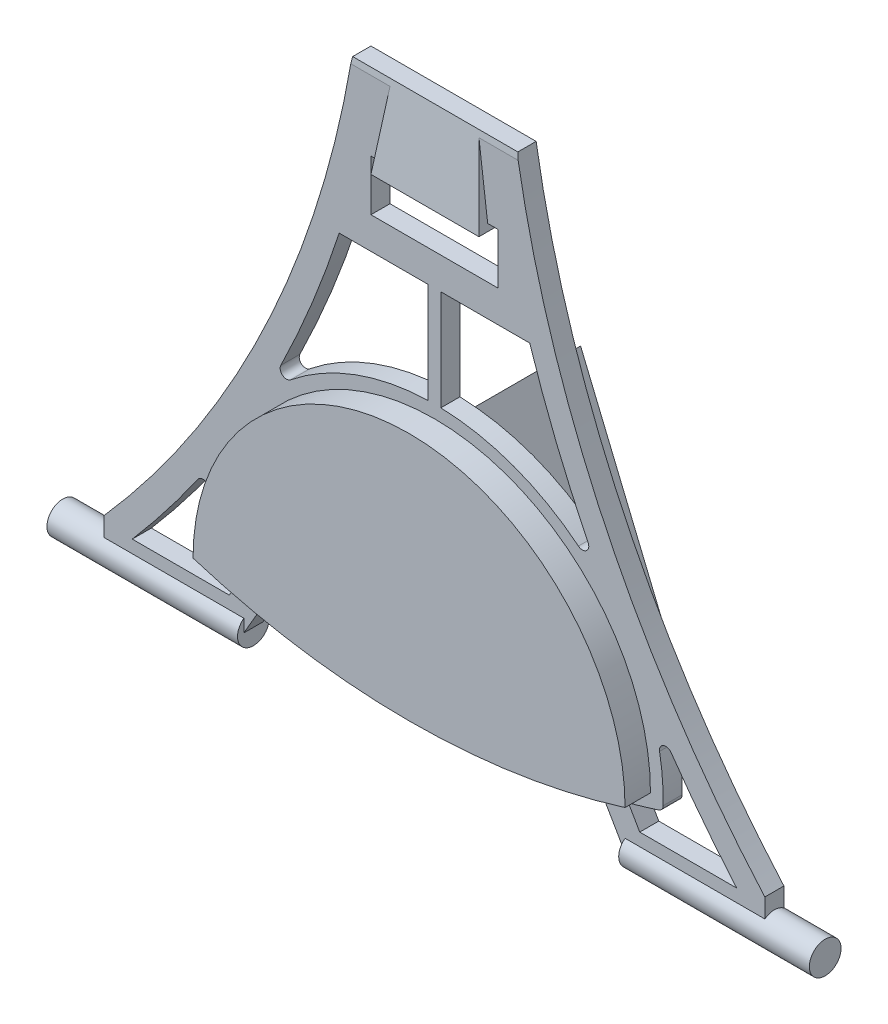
ISO-10303-21;
HEADER;
FILE_DESCRIPTION(('STEP AP214'),'2;1');
FILE_NAME('part.step','',(''),(''),'','','');
FILE_SCHEMA(('AUTOMOTIVE_DESIGN { 1 0 10303 214 1 1 1 1 }'));
ENDSEC;
DATA;
#1=APPLICATION_CONTEXT('core data for automotive mechanical design processes');
#2=APPLICATION_PROTOCOL_DEFINITION('international standard','automotive_design',2000,#1);
#3=PRODUCT_CONTEXT('',#1,'mechanical');
#4=PRODUCT('Part','Part','',(#3));
#5=PRODUCT_RELATED_PRODUCT_CATEGORY('part','',(#4));
#6=PRODUCT_DEFINITION_FORMATION('','',#4);
#7=PRODUCT_DEFINITION_CONTEXT('part definition',#1,'design');
#8=PRODUCT_DEFINITION('design','',#6,#7);
#9=PRODUCT_DEFINITION_SHAPE('','',#8);
#10=(LENGTH_UNIT() NAMED_UNIT(*) SI_UNIT(.MILLI.,.METRE.));
#11=(NAMED_UNIT(*) PLANE_ANGLE_UNIT() SI_UNIT($,.RADIAN.));
#12=(NAMED_UNIT(*) SI_UNIT($,.STERADIAN.) SOLID_ANGLE_UNIT());
#13=UNCERTAINTY_MEASURE_WITH_UNIT(LENGTH_MEASURE(1.E-05),#10,'distance_accuracy_value','');
#14=(GEOMETRIC_REPRESENTATION_CONTEXT(3) GLOBAL_UNCERTAINTY_ASSIGNED_CONTEXT((#13)) GLOBAL_UNIT_ASSIGNED_CONTEXT((#10,
#11,#12)) REPRESENTATION_CONTEXT('',''));
#15=CARTESIAN_POINT('',(0.,0.,0.));
#16=DIRECTION('',(0.,0.,1.));
#17=DIRECTION('',(1.,0.,0.));
#18=AXIS2_PLACEMENT_3D('',#15,#16,#17);
#19=CARTESIAN_POINT('',(0.,64.5941179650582,3.5));
#20=DIRECTION('',(0.,0.,-1.));
#21=DIRECTION('',(-1.,0.,0.));
#22=AXIS2_PLACEMENT_3D('',#19,#20,#21);
#23=PLANE('',#22);
#24=DIRECTION('',(-0.382683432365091,-0.923879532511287,0.));
#25=VECTOR('',#24,1.);
#26=CARTESIAN_POINT('',(0.,40.,3.5));
#27=LINE('',#26,#25);
#28=CARTESIAN_POINT('',(0.,40.,3.5));
#29=VERTEX_POINT('',#28);
#30=CARTESIAN_POINT('',(-13.7361570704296,6.83798330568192,3.5));
#31=VERTEX_POINT('',#30);
#32=EDGE_CURVE('E578',#29,#31,#27,.T.);
#33=ORIENTED_EDGE('',*,*,#32,.F.);
#34=DIRECTION('',(0.382683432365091,-0.923879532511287,0.));
#35=VECTOR('',#34,1.);
#36=CARTESIAN_POINT('',(-8.6953337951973,60.9923927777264,3.5));
#37=LINE('',#36,#35);
#38=CARTESIAN_POINT('',(13.7361570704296,6.83798330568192,3.5));
#39=VERTEX_POINT('',#38);
#40=EDGE_CURVE('E11',#29,#39,#37,.T.);
#41=ORIENTED_EDGE('',*,*,#40,.T.);
#42=CARTESIAN_POINT('',(0.,119.,3.5));
#43=DIRECTION('',(0.,0.,-1.));
#44=DIRECTION('',(-1.,0.,0.));
#45=AXIS2_PLACEMENT_3D('',#42,#43,#44);
#46=CIRCLE('',#45,113.);
#47=EDGE_CURVE('E833',#39,#31,#46,.T.);
#48=ORIENTED_EDGE('',*,*,#47,.T.);
#49=EDGE_LOOP('',(#33,#41,#48));
#50=FACE_BOUND('',#49,.T.);
#51=DIRECTION('',(0.,1.,0.));
#52=VECTOR('',#51,1.);
#53=CARTESIAN_POINT('',(2.5,10.5,3.5));
#54=LINE('',#53,#52);
#55=CARTESIAN_POINT('',(2.5,10.5,3.5));
#56=VERTEX_POINT('',#55);
#57=CARTESIAN_POINT('',(2.5,11.5,3.5));
#58=VERTEX_POINT('',#57);
#59=EDGE_CURVE('E46',#56,#58,#54,.T.);
#60=ORIENTED_EDGE('',*,*,#59,.T.);
#61=DIRECTION('',(-1.,0.,0.));
#62=VECTOR('',#61,1.);
#63=CARTESIAN_POINT('',(-2.5,11.5,3.5));
#64=LINE('',#63,#62);
#65=CARTESIAN_POINT('',(0.5,11.5,3.5));
#66=VERTEX_POINT('',#65);
#67=EDGE_CURVE('E1928',#66,#58,#64,.F.);
#68=ORIENTED_EDGE('',*,*,#67,.F.);
#69=DIRECTION('',(0.,1.,0.));
#70=VECTOR('',#69,1.);
#71=CARTESIAN_POINT('',(0.5,8.5,3.5));
#72=LINE('',#71,#70);
#73=CARTESIAN_POINT('',(0.5,13.5,3.5));
#74=VERTEX_POINT('',#73);
#75=EDGE_CURVE('E547',#66,#74,#72,.T.);
#76=ORIENTED_EDGE('',*,*,#75,.T.);
#77=DIRECTION('',(-1.,0.,0.));
#78=VECTOR('',#77,1.);
#79=CARTESIAN_POINT('',(0.5,13.5,3.5));
#80=LINE('',#79,#78);
#81=CARTESIAN_POINT('',(-0.5,13.5,3.5));
#82=VERTEX_POINT('',#81);
#83=EDGE_CURVE('E544',#74,#82,#80,.T.);
#84=ORIENTED_EDGE('',*,*,#83,.T.);
#85=DIRECTION('',(0.,1.,0.));
#86=VECTOR('',#85,1.);
#87=CARTESIAN_POINT('',(-0.5,8.5,3.5));
#88=LINE('',#87,#86);
#89=CARTESIAN_POINT('',(-0.5,11.5,3.5));
#90=VERTEX_POINT('',#89);
#91=EDGE_CURVE('E541',#90,#82,#88,.T.);
#92=ORIENTED_EDGE('',*,*,#91,.F.);
#93=CARTESIAN_POINT('',(-2.5,11.5,3.5));
#94=VERTEX_POINT('',#93);
#95=EDGE_CURVE('E512',#94,#90,#64,.F.);
#96=ORIENTED_EDGE('',*,*,#95,.F.);
#97=DIRECTION('',(0.,-1.,0.));
#98=VECTOR('',#97,1.);
#99=CARTESIAN_POINT('',(-2.5,11.5,3.5));
#100=LINE('',#99,#98);
#101=CARTESIAN_POINT('',(-2.5,10.5,3.5));
#102=VERTEX_POINT('',#101);
#103=EDGE_CURVE('E495',#94,#102,#100,.T.);
#104=ORIENTED_EDGE('',*,*,#103,.T.);
#105=DIRECTION('',(-1.,0.,0.));
#106=VECTOR('',#105,1.);
#107=CARTESIAN_POINT('',(-2.5,10.5,3.5));
#108=LINE('',#107,#106);
#109=CARTESIAN_POINT('',(-0.5,10.5,3.5));
#110=VERTEX_POINT('',#109);
#111=EDGE_CURVE('E505',#102,#110,#108,.F.);
#112=ORIENTED_EDGE('',*,*,#111,.T.);
#113=CARTESIAN_POINT('',(-0.5,8.5,3.5));
#114=VERTEX_POINT('',#113);
#115=EDGE_CURVE('E542',#114,#110,#88,.T.);
#116=ORIENTED_EDGE('',*,*,#115,.F.);
#117=DIRECTION('',(1.,0.,0.));
#118=VECTOR('',#117,1.);
#119=CARTESIAN_POINT('',(-0.5,8.5,3.5));
#120=LINE('',#119,#118);
#121=CARTESIAN_POINT('',(0.5,8.5,3.5));
#122=VERTEX_POINT('',#121);
#123=EDGE_CURVE('E550',#114,#122,#120,.T.);
#124=ORIENTED_EDGE('',*,*,#123,.T.);
#125=CARTESIAN_POINT('',(0.5,10.5,3.5));
#126=VERTEX_POINT('',#125);
#127=EDGE_CURVE('E548',#122,#126,#72,.T.);
#128=ORIENTED_EDGE('',*,*,#127,.T.);
#129=EDGE_CURVE('E51',#126,#56,#108,.F.);
#130=ORIENTED_EDGE('',*,*,#129,.T.);
#131=EDGE_LOOP('',(#60,#68,#76,#84,#92,#96,#104,#112,#116,#124,#128,#130));
#132=FACE_BOUND('',#131,.T.);
#133=ADVANCED_FACE('F31',(#50,#132),#23,.T.);
#134=CARTESIAN_POINT('',(-0.5,8.5,-8.5));
#135=DIRECTION('',(1.,0.,0.));
#136=DIRECTION('',(0.,0.,-1.));
#137=AXIS2_PLACEMENT_3D('',#134,#135,#136);
#138=PLANE('',#137);
#139=DIRECTION('',(0.,0.,-1.));
#140=VECTOR('',#139,1.);
#141=CARTESIAN_POINT('',(-0.5,11.5,-8.5));
#142=LINE('',#141,#140);
#143=CARTESIAN_POINT('',(-0.5,11.5,-8.5));
#144=VERTEX_POINT('',#143);
#145=EDGE_CURVE('E538',#90,#144,#142,.T.);
#146=ORIENTED_EDGE('',*,*,#145,.F.);
#147=ORIENTED_EDGE('',*,*,#91,.T.);
#148=DIRECTION('',(0.,0.,1.));
#149=VECTOR('',#148,1.);
#150=CARTESIAN_POINT('',(-0.5,13.5,-8.5));
#151=LINE('',#150,#149);
#152=CARTESIAN_POINT('',(-0.5,13.5,-8.5));
#153=VERTEX_POINT('',#152);
#154=EDGE_CURVE('E574',#153,#82,#151,.T.);
#155=ORIENTED_EDGE('',*,*,#154,.F.);
#156=DIRECTION('',(0.,1.,0.));
#157=VECTOR('',#156,1.);
#158=CARTESIAN_POINT('',(-0.5,8.5,-8.5));
#159=LINE('',#158,#157);
#160=EDGE_CURVE('E552',#144,#153,#159,.T.);
#161=ORIENTED_EDGE('',*,*,#160,.F.);
#162=EDGE_LOOP('',(#146,#147,#155,#161));
#163=FACE_BOUND('',#162,.T.);
#164=ADVANCED_FACE('F1177',(#163),#138,.F.);
#165=CARTESIAN_POINT('',(0.5,8.5,-8.5));
#166=DIRECTION('',(1.,0.,0.));
#167=DIRECTION('',(0.,0.,-1.));
#168=AXIS2_PLACEMENT_3D('',#165,#166,#167);
#169=PLANE('',#168);
#170=ORIENTED_EDGE('',*,*,#75,.F.);
#171=DIRECTION('',(0.,0.,-1.));
#172=VECTOR('',#171,1.);
#173=CARTESIAN_POINT('',(0.5,11.5,-8.5));
#174=LINE('',#173,#172);
#175=CARTESIAN_POINT('',(0.5,11.5,-8.5));
#176=VERTEX_POINT('',#175);
#177=EDGE_CURVE('E535',#66,#176,#174,.T.);
#178=ORIENTED_EDGE('',*,*,#177,.T.);
#179=DIRECTION('',(0.,1.,0.));
#180=VECTOR('',#179,1.);
#181=CARTESIAN_POINT('',(0.5,8.5,-8.5));
#182=LINE('',#181,#180);
#183=CARTESIAN_POINT('',(0.5,13.5,-8.5));
#184=VERTEX_POINT('',#183);
#185=EDGE_CURVE('E559',#176,#184,#182,.T.);
#186=ORIENTED_EDGE('',*,*,#185,.T.);
#187=DIRECTION('',(0.,0.,1.));
#188=VECTOR('',#187,1.);
#189=CARTESIAN_POINT('',(0.5,13.5,-8.5));
#190=LINE('',#189,#188);
#191=EDGE_CURVE('E571',#184,#74,#190,.T.);
#192=ORIENTED_EDGE('',*,*,#191,.T.);
#193=EDGE_LOOP('',(#170,#178,#186,#192));
#194=FACE_BOUND('',#193,.T.);
#195=ADVANCED_FACE('F1183',(#194),#169,.T.);
#196=CARTESIAN_POINT('',(0.,119.,-1.5));
#197=DIRECTION('',(0.,0.,1.));
#198=DIRECTION('',(1.,0.,0.));
#199=AXIS2_PLACEMENT_3D('',#196,#197,#198);
#200=PLANE('',#199);
#201=DIRECTION('',(-0.382683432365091,-0.923879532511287,0.));
#202=VECTOR('',#201,1.);
#203=CARTESIAN_POINT('',(27.9307178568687,107.430717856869,-1.5));
#204=LINE('',#203,#202);
#205=CARTESIAN_POINT('',(-13.7361570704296,6.83798330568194,-1.5));
#206=VERTEX_POINT('',#205);
#207=CARTESIAN_POINT('',(-14.1331840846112,5.87947530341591,-1.5));
#208=VERTEX_POINT('',#207);
#209=EDGE_CURVE('E628',#206,#208,#204,.T.);
#210=ORIENTED_EDGE('',*,*,#209,.F.);
#211=CARTESIAN_POINT('',(0.,119.,-1.5));
#212=DIRECTION('',(0.,0.,-1.));
#213=DIRECTION('',(-1.,0.,0.));
#214=AXIS2_PLACEMENT_3D('',#211,#212,#213);
#215=CIRCLE('',#214,113.);
#216=CARTESIAN_POINT('',(13.7361570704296,6.83798330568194,-1.5));
#217=VERTEX_POINT('',#216);
#218=EDGE_CURVE('E825',#217,#206,#215,.T.);
#219=ORIENTED_EDGE('',*,*,#218,.F.);
#220=DIRECTION('',(-0.382683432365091,0.923879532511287,0.));
#221=VECTOR('',#220,1.);
#222=CARTESIAN_POINT('',(-27.9307178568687,107.430717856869,-1.5));
#223=LINE('',#222,#221);
#224=CARTESIAN_POINT('',(14.1331840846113,5.87947530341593,-1.5));
#225=VERTEX_POINT('',#224);
#226=EDGE_CURVE('E634',#225,#217,#223,.T.);
#227=ORIENTED_EDGE('',*,*,#226,.F.);
#228=CARTESIAN_POINT('',(0.,119.,-1.5));
#229=DIRECTION('',(0.,0.,1.));
#230=DIRECTION('',(1.,0.,0.));
#231=AXIS2_PLACEMENT_3D('',#228,#229,#230);
#232=CIRCLE('',#231,114.);
#233=EDGE_CURVE('E931',#208,#225,#232,.T.);
#234=ORIENTED_EDGE('',*,*,#233,.F.);
#235=EDGE_LOOP('',(#210,#219,#227,#234));
#236=FACE_BOUND('',#235,.T.);
#237=ADVANCED_FACE('F1078',(#236),#200,.F.);
#238=DIRECTION('',(-1.,0.,0.));
#239=VECTOR('',#238,1.);
#240=CARTESIAN_POINT('',(0.,75.,-1.5));
#241=LINE('',#240,#239);
#242=CARTESIAN_POINT('',(10.,75.,-1.5));
#243=VERTEX_POINT('',#242);
#244=CARTESIAN_POINT('',(8.375,75.,-1.5));
#245=VERTEX_POINT('',#244);
#246=EDGE_CURVE('E1031',#243,#245,#241,.T.);
#247=ORIENTED_EDGE('',*,*,#246,.T.);
#248=DIRECTION('',(0.124034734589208,-0.992277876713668,0.));
#249=VECTOR('',#248,1.);
#250=CARTESIAN_POINT('',(7.,86.,-1.5));
#251=LINE('',#250,#249);
#252=CARTESIAN_POINT('',(8.5,74.,-1.5));
#253=VERTEX_POINT('',#252);
#254=EDGE_CURVE('E661',#245,#253,#251,.T.);
#255=ORIENTED_EDGE('',*,*,#254,.T.);
#256=DIRECTION('',(-1.,0.,0.));
#257=VECTOR('',#256,1.);
#258=CARTESIAN_POINT('',(-8.5,74.,-1.5));
#259=LINE('',#258,#257);
#260=CARTESIAN_POINT('',(-8.5,74.,-1.5));
#261=VERTEX_POINT('',#260);
#262=EDGE_CURVE('E656',#253,#261,#259,.T.);
#263=ORIENTED_EDGE('',*,*,#262,.T.);
#264=DIRECTION('',(0.124034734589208,0.992277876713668,0.));
#265=VECTOR('',#264,1.);
#266=CARTESIAN_POINT('',(-7.,86.,-1.5));
#267=LINE('',#266,#265);
#268=CARTESIAN_POINT('',(-8.375,75.,-1.5));
#269=VERTEX_POINT('',#268);
#270=EDGE_CURVE('E659',#261,#269,#267,.T.);
#271=ORIENTED_EDGE('',*,*,#270,.T.);
#272=CARTESIAN_POINT('',(-10.,75.,-1.5));
#273=VERTEX_POINT('',#272);
#274=EDGE_CURVE('E1030',#269,#273,#241,.T.);
#275=ORIENTED_EDGE('',*,*,#274,.T.);
#276=DIRECTION('',(0.,-1.,0.));
#277=VECTOR('',#276,1.);
#278=CARTESIAN_POINT('',(-9.99999999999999,119.,-1.5));
#279=LINE('',#278,#277);
#280=CARTESIAN_POINT('',(-10.,67.,-1.5));
#281=VERTEX_POINT('',#280);
#282=EDGE_CURVE('E1034',#273,#281,#279,.T.);
#283=ORIENTED_EDGE('',*,*,#282,.T.);
#284=DIRECTION('',(1.,0.,0.));
#285=VECTOR('',#284,1.);
#286=CARTESIAN_POINT('',(0.,67.,-1.5));
#287=LINE('',#286,#285);
#288=CARTESIAN_POINT('',(10.,67.,-1.5));
#289=VERTEX_POINT('',#288);
#290=EDGE_CURVE('E1024',#281,#289,#287,.T.);
#291=ORIENTED_EDGE('',*,*,#290,.T.);
#292=DIRECTION('',(0.,1.,0.));
#293=VECTOR('',#292,1.);
#294=CARTESIAN_POINT('',(9.99999999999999,119.,-1.5));
#295=LINE('',#294,#293);
#296=EDGE_CURVE('E1027',#289,#243,#295,.T.);
#297=ORIENTED_EDGE('',*,*,#296,.T.);
#298=EDGE_LOOP('',(#247,#255,#263,#271,#275,#283,#291,#297));
#299=FACE_BOUND('',#298,.T.);
#300=CARTESIAN_POINT('',(-36.4145567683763,16.7441535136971,-1.5));
#301=DIRECTION('',(0.,0.,1.));
#302=DIRECTION('',(1.,0.,0.));
#303=AXIS2_PLACEMENT_3D('',#300,#301,#302);
#304=CIRCLE('',#303,0.999999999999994);
#305=CARTESIAN_POINT('',(-37.2341994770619,17.3170285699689,-1.5));
#306=VERTEX_POINT('',#305);
#307=CARTESIAN_POINT('',(-35.4303795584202,16.5669665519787,-1.5));
#308=VERTEX_POINT('',#307);
#309=EDGE_CURVE('E1011',#306,#308,#304,.F.);
#310=ORIENTED_EDGE('',*,*,#309,.F.);
#311=CARTESIAN_POINT('',(-175.753817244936,114.132913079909,-1.5));
#312=DIRECTION('',(0.,0.,1.));
#313=DIRECTION('',(1.,0.,0.));
#314=AXIS2_PLACEMENT_3D('',#311,#312,#313);
#315=CIRCLE('',#314,169.);
#316=CARTESIAN_POINT('',(-47.5674628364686,4.00000000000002,-1.5));
#317=VERTEX_POINT('',#316);
#318=EDGE_CURVE('E998',#317,#306,#315,.T.);
#319=ORIENTED_EDGE('',*,*,#318,.F.);
#320=DIRECTION('',(-1.,0.,0.));
#321=VECTOR('',#320,1.);
#322=CARTESIAN_POINT('',(0.,3.99999999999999,-1.5));
#323=LINE('',#322,#321);
#324=CARTESIAN_POINT('',(-32.3094010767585,4.,-1.5));
#325=VERTEX_POINT('',#324);
#326=EDGE_CURVE('E1000',#325,#317,#323,.T.);
#327=ORIENTED_EDGE('',*,*,#326,.F.);
#328=DIRECTION('',(-0.499999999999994,-0.866025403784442,0.));
#329=VECTOR('',#328,1.);
#330=CARTESIAN_POINT('',(25.5644099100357,104.240381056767,-1.5));
#331=LINE('',#330,#329);
#332=CARTESIAN_POINT('',(-30.5261744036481,7.08863919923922,-1.5));
#333=VERTEX_POINT('',#332);
#334=EDGE_CURVE('E1003',#333,#325,#331,.T.);
#335=ORIENTED_EDGE('',*,*,#334,.F.);
#336=CARTESIAN_POINT('',(0.,119.,-1.5));
#337=DIRECTION('',(0.,0.,1.));
#338=DIRECTION('',(1.,0.,0.));
#339=AXIS2_PLACEMENT_3D('',#336,#337,#338);
#340=CIRCLE('',#339,116.);
#341=CARTESIAN_POINT('',(-35.2965578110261,8.50043888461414,-1.5));
#342=VERTEX_POINT('',#341);
#343=EDGE_CURVE('E1005',#342,#333,#340,.T.);
#344=ORIENTED_EDGE('',*,*,#343,.F.);
#345=CARTESIAN_POINT('',(-34.9922771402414,9.45302130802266,-1.5));
#346=DIRECTION('',(0.,0.,1.));
#347=DIRECTION('',(1.,0.,0.));
#348=AXIS2_PLACEMENT_3D('',#345,#346,#347);
#349=CIRCLE('',#348,1.);
#350=CARTESIAN_POINT('',(-35.9920564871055,9.43201517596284,-1.5));
#351=VERTEX_POINT('',#350);
#352=EDGE_CURVE('E1007',#351,#342,#349,.T.);
#353=ORIENTED_EDGE('',*,*,#352,.F.);
#354=CARTESIAN_POINT('',(0.,10.1882359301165,-1.5));
#355=DIRECTION('',(0.,0.,1.));
#356=DIRECTION('',(1.,0.,0.));
#357=AXIS2_PLACEMENT_3D('',#354,#355,#356);
#358=CIRCLE('',#357,36.);
#359=EDGE_CURVE('E1009',#308,#351,#358,.T.);
#360=ORIENTED_EDGE('',*,*,#359,.F.);
#361=EDGE_LOOP('',(#310,#319,#327,#335,#344,#353,#360));
#362=FACE_BOUND('',#361,.T.);
#363=DIRECTION('',(0.,-1.,0.));
#364=VECTOR('',#363,1.);
#365=CARTESIAN_POINT('',(1.,119.,-1.5));
#366=LINE('',#365,#364);
#367=CARTESIAN_POINT('',(1.,62.,-1.5));
#368=VERTEX_POINT('',#367);
#369=CARTESIAN_POINT('',(1.,46.1743443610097,-1.5));
#370=VERTEX_POINT('',#369);
#371=EDGE_CURVE('E992',#368,#370,#366,.T.);
#372=ORIENTED_EDGE('',*,*,#371,.T.);
#373=CARTESIAN_POINT('',(0.,10.1882359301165,-1.5));
#374=DIRECTION('',(0.,0.,1.));
#375=DIRECTION('',(1.,0.,0.));
#376=AXIS2_PLACEMENT_3D('',#373,#374,#375);
#377=CIRCLE('',#376,36.);
#378=CARTESIAN_POINT('',(22.657458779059,38.1639318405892,-1.5));
#379=VERTEX_POINT('',#378);
#380=EDGE_CURVE('E995',#370,#379,#377,.F.);
#381=ORIENTED_EDGE('',*,*,#380,.T.);
#382=CARTESIAN_POINT('',(23.2868326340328,38.941034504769,-1.5));
#383=DIRECTION('',(0.,0.,1.));
#384=DIRECTION('',(1.,0.,0.));
#385=AXIS2_PLACEMENT_3D('',#382,#383,#384);
#386=CIRCLE('',#385,1.);
#387=CARTESIAN_POINT('',(24.1836972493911,39.3833396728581,-1.5));
#388=VERTEX_POINT('',#387);
#389=EDGE_CURVE('E983',#379,#388,#386,.T.);
#390=ORIENTED_EDGE('',*,*,#389,.T.);
#391=CARTESIAN_POINT('',(175.753817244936,114.132913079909,-1.5));
#392=DIRECTION('',(0.,0.,1.));
#393=DIRECTION('',(1.,0.,0.));
#394=AXIS2_PLACEMENT_3D('',#391,#392,#393);
#395=CIRCLE('',#394,169.);
#396=CARTESIAN_POINT('',(14.9957400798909,62.,-1.5));
#397=VERTEX_POINT('',#396);
#398=EDGE_CURVE('E986',#388,#397,#395,.F.);
#399=ORIENTED_EDGE('',*,*,#398,.T.);
#400=DIRECTION('',(-1.,0.,0.));
#401=VECTOR('',#400,1.);
#402=CARTESIAN_POINT('',(0.,62.,-1.5));
#403=LINE('',#402,#401);
#404=EDGE_CURVE('E989',#397,#368,#403,.T.);
#405=ORIENTED_EDGE('',*,*,#404,.T.);
#406=EDGE_LOOP('',(#372,#381,#390,#399,#405));
#407=FACE_BOUND('',#406,.T.);
#408=CARTESIAN_POINT('',(175.753817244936,114.132913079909,-1.5));
#409=DIRECTION('',(0.,0.,1.));
#410=DIRECTION('',(1.,0.,0.));
#411=AXIS2_PLACEMENT_3D('',#408,#409,#410);
#412=CIRCLE('',#411,169.);
#413=CARTESIAN_POINT('',(47.5674628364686,4.00000000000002,-1.5));
#414=VERTEX_POINT('',#413);
#415=CARTESIAN_POINT('',(37.2341994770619,17.3170285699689,-1.5));
#416=VERTEX_POINT('',#415);
#417=EDGE_CURVE('E977',#414,#416,#412,.F.);
#418=ORIENTED_EDGE('',*,*,#417,.T.);
#419=CARTESIAN_POINT('',(36.4145567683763,16.7441535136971,-1.5));
#420=DIRECTION('',(0.,0.,1.));
#421=DIRECTION('',(1.,0.,0.));
#422=AXIS2_PLACEMENT_3D('',#419,#420,#421);
#423=CIRCLE('',#422,0.999999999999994);
#424=CARTESIAN_POINT('',(35.4303795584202,16.5669665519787,-1.5));
#425=VERTEX_POINT('',#424);
#426=EDGE_CURVE('E980',#416,#425,#423,.T.);
#427=ORIENTED_EDGE('',*,*,#426,.T.);
#428=CARTESIAN_POINT('',(0.,10.1882359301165,-1.5));
#429=DIRECTION('',(0.,0.,1.));
#430=DIRECTION('',(1.,0.,0.));
#431=AXIS2_PLACEMENT_3D('',#428,#429,#430);
#432=CIRCLE('',#431,36.);
#433=CARTESIAN_POINT('',(35.9920564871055,9.43201517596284,-1.5));
#434=VERTEX_POINT('',#433);
#435=EDGE_CURVE('E962',#425,#434,#432,.F.);
#436=ORIENTED_EDGE('',*,*,#435,.T.);
#437=CARTESIAN_POINT('',(34.9922771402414,9.45302130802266,-1.5));
#438=DIRECTION('',(0.,0.,1.));
#439=DIRECTION('',(1.,0.,0.));
#440=AXIS2_PLACEMENT_3D('',#437,#438,#439);
#441=CIRCLE('',#440,1.);
#442=CARTESIAN_POINT('',(35.2965578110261,8.50043888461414,-1.5));
#443=VERTEX_POINT('',#442);
#444=EDGE_CURVE('E965',#434,#443,#441,.F.);
#445=ORIENTED_EDGE('',*,*,#444,.T.);
#446=CARTESIAN_POINT('',(0.,119.,-1.5));
#447=DIRECTION('',(0.,0.,1.));
#448=DIRECTION('',(1.,0.,0.));
#449=AXIS2_PLACEMENT_3D('',#446,#447,#448);
#450=CIRCLE('',#449,116.);
#451=CARTESIAN_POINT('',(30.5261744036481,7.08863919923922,-1.5));
#452=VERTEX_POINT('',#451);
#453=EDGE_CURVE('E968',#443,#452,#450,.F.);
#454=ORIENTED_EDGE('',*,*,#453,.T.);
#455=DIRECTION('',(0.499999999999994,-0.866025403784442,0.));
#456=VECTOR('',#455,1.);
#457=CARTESIAN_POINT('',(-25.5644099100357,104.240381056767,-1.5));
#458=LINE('',#457,#456);
#459=CARTESIAN_POINT('',(32.3094010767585,4.,-1.5));
#460=VERTEX_POINT('',#459);
#461=EDGE_CURVE('E971',#452,#460,#458,.T.);
#462=ORIENTED_EDGE('',*,*,#461,.T.);
#463=DIRECTION('',(1.,0.,0.));
#464=VECTOR('',#463,1.);
#465=CARTESIAN_POINT('',(0.,3.99999999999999,-1.5));
#466=LINE('',#465,#464);
#467=EDGE_CURVE('E974',#460,#414,#466,.T.);
#468=ORIENTED_EDGE('',*,*,#467,.T.);
#469=EDGE_LOOP('',(#418,#427,#436,#445,#454,#462,#468));
#470=FACE_BOUND('',#469,.T.);
#471=CARTESIAN_POINT('',(0.,10.1882359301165,-1.5));
#472=DIRECTION('',(0.,0.,1.));
#473=DIRECTION('',(1.,0.,0.));
#474=AXIS2_PLACEMENT_3D('',#471,#472,#473);
#475=CIRCLE('',#474,36.);
#476=CARTESIAN_POINT('',(-1.,46.1743443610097,-1.5));
#477=VERTEX_POINT('',#476);
#478=CARTESIAN_POINT('',(-22.657458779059,38.1639318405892,-1.5));
#479=VERTEX_POINT('',#478);
#480=EDGE_CURVE('E1022',#477,#479,#475,.T.);
#481=ORIENTED_EDGE('',*,*,#480,.F.);
#482=DIRECTION('',(0.,-1.,0.));
#483=VECTOR('',#482,1.);
#484=CARTESIAN_POINT('',(-1.,119.,-1.5));
#485=LINE('',#484,#483);
#486=CARTESIAN_POINT('',(-1.,62.,-1.5));
#487=VERTEX_POINT('',#486);
#488=EDGE_CURVE('E1013',#487,#477,#485,.T.);
#489=ORIENTED_EDGE('',*,*,#488,.F.);
#490=DIRECTION('',(1.,0.,0.));
#491=VECTOR('',#490,1.);
#492=CARTESIAN_POINT('',(0.,62.,-1.5));
#493=LINE('',#492,#491);
#494=CARTESIAN_POINT('',(-14.9957400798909,62.,-1.5));
#495=VERTEX_POINT('',#494);
#496=EDGE_CURVE('E1015',#495,#487,#493,.T.);
#497=ORIENTED_EDGE('',*,*,#496,.F.);
#498=CARTESIAN_POINT('',(-175.753817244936,114.132913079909,-1.5));
#499=DIRECTION('',(0.,0.,1.));
#500=DIRECTION('',(1.,0.,0.));
#501=AXIS2_PLACEMENT_3D('',#498,#499,#500);
#502=CIRCLE('',#501,169.);
#503=CARTESIAN_POINT('',(-24.1836972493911,39.3833396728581,-1.5));
#504=VERTEX_POINT('',#503);
#505=EDGE_CURVE('E1018',#504,#495,#502,.T.);
#506=ORIENTED_EDGE('',*,*,#505,.F.);
#507=CARTESIAN_POINT('',(-23.2868326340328,38.941034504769,-1.5));
#508=DIRECTION('',(0.,0.,1.));
#509=DIRECTION('',(1.,0.,0.));
#510=AXIS2_PLACEMENT_3D('',#507,#508,#509);
#511=CIRCLE('',#510,1.);
#512=EDGE_CURVE('E1020',#479,#504,#511,.F.);
#513=ORIENTED_EDGE('',*,*,#512,.F.);
#514=EDGE_LOOP('',(#481,#489,#497,#506,#513));
#515=FACE_BOUND('',#514,.T.);
#516=DIRECTION('',(-0.92387953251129,0.382683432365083,0.));
#517=VECTOR('',#516,1.);
#518=CARTESIAN_POINT('',(-42.0639019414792,17.4487574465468,-1.5));
#519=LINE('',#518,#517);
#520=CARTESIAN_POINT('',(-15.0570636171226,6.26215873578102,-1.5));
#521=VERTEX_POINT('',#520);
#522=EDGE_CURVE('E637',#208,#521,#519,.T.);
#523=ORIENTED_EDGE('',*,*,#522,.F.);
#524=CARTESIAN_POINT('',(-25.4518993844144,7.87754134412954,-1.5));
#525=VERTEX_POINT('',#524);
#526=EDGE_CURVE('E927',#525,#208,#232,.T.);
#527=ORIENTED_EDGE('',*,*,#526,.F.);
#528=DIRECTION('',(0.5,0.866025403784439,0.));
#529=VECTOR('',#528,1.);
#530=CARTESIAN_POINT('',(-30.,0.,-1.5));
#531=LINE('',#530,#529);
#532=CARTESIAN_POINT('',(-30.,0.,-1.5));
#533=VERTEX_POINT('',#532);
#534=EDGE_CURVE('E923',#533,#525,#531,.T.);
#535=ORIENTED_EDGE('',*,*,#534,.F.);
#536=DIRECTION('',(0.,-1.,0.));
#537=VECTOR('',#536,1.);
#538=CARTESIAN_POINT('',(-30.,119.,-1.5));
#539=LINE('',#538,#537);
#540=CARTESIAN_POINT('',(-30.,2.,-1.5));
#541=VERTEX_POINT('',#540);
#542=EDGE_CURVE('E875',#541,#533,#539,.T.);
#543=ORIENTED_EDGE('',*,*,#542,.F.);
#544=DIRECTION('',(1.,0.,0.));
#545=VECTOR('',#544,1.);
#546=CARTESIAN_POINT('',(-30.,2.,-1.5));
#547=LINE('',#546,#545);
#548=CARTESIAN_POINT('',(-52.,2.,-1.5));
#549=VERTEX_POINT('',#548);
#550=EDGE_CURVE('E870',#549,#541,#547,.T.);
#551=ORIENTED_EDGE('',*,*,#550,.F.);
#552=DIRECTION('',(0.,-1.,0.));
#553=VECTOR('',#552,1.);
#554=CARTESIAN_POINT('',(-52.,0.,-1.5));
#555=LINE('',#554,#553);
#556=CARTESIAN_POINT('',(-52.,5.00000000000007,-1.5));
#557=VERTEX_POINT('',#556);
#558=EDGE_CURVE('E920',#557,#549,#555,.T.);
#559=ORIENTED_EDGE('',*,*,#558,.F.);
#560=CARTESIAN_POINT('',(-175.753817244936,114.132913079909,-1.5));
#561=DIRECTION('',(0.,0.,-1.));
#562=DIRECTION('',(-1.,0.,0.));
#563=AXIS2_PLACEMENT_3D('',#560,#561,#562);
#564=CIRCLE('',#563,165.);
#565=CARTESIAN_POINT('',(-13.,87.,-1.5));
#566=VERTEX_POINT('',#565);
#567=EDGE_CURVE('E917',#566,#557,#564,.T.);
#568=ORIENTED_EDGE('',*,*,#567,.F.);
#569=DIRECTION('',(-1.,0.,0.));
#570=VECTOR('',#569,1.);
#571=CARTESIAN_POINT('',(-13.,87.,-1.5));
#572=LINE('',#571,#570);
#573=CARTESIAN_POINT('',(13.,87.,-1.5));
#574=VERTEX_POINT('',#573);
#575=EDGE_CURVE('E914',#574,#566,#572,.T.);
#576=ORIENTED_EDGE('',*,*,#575,.F.);
#577=CARTESIAN_POINT('',(175.753817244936,114.132913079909,-1.5));
#578=DIRECTION('',(0.,0.,-1.));
#579=DIRECTION('',(1.,0.,0.));
#580=AXIS2_PLACEMENT_3D('',#577,#578,#579);
#581=CIRCLE('',#580,165.);
#582=CARTESIAN_POINT('',(52.,5.,-1.5));
#583=VERTEX_POINT('',#582);
#584=EDGE_CURVE('E911',#583,#574,#581,.T.);
#585=ORIENTED_EDGE('',*,*,#584,.F.);
#586=DIRECTION('',(0.,1.,0.));
#587=VECTOR('',#586,1.);
#588=CARTESIAN_POINT('',(52.,0.,-1.5));
#589=LINE('',#588,#587);
#590=CARTESIAN_POINT('',(52.,2.,-1.5));
#591=VERTEX_POINT('',#590);
#592=EDGE_CURVE('E909',#591,#583,#589,.T.);
#593=ORIENTED_EDGE('',*,*,#592,.F.);
#594=DIRECTION('',(-1.,0.,0.));
#595=VECTOR('',#594,1.);
#596=CARTESIAN_POINT('',(30.,2.,-1.5));
#597=LINE('',#596,#595);
#598=CARTESIAN_POINT('',(30.,2.,-1.5));
#599=VERTEX_POINT('',#598);
#600=EDGE_CURVE('E886',#599,#591,#597,.F.);
#601=ORIENTED_EDGE('',*,*,#600,.F.);
#602=DIRECTION('',(0.,1.,0.));
#603=VECTOR('',#602,1.);
#604=CARTESIAN_POINT('',(30.,119.,-1.5));
#605=LINE('',#604,#603);
#606=CARTESIAN_POINT('',(30.,0.,-1.5));
#607=VERTEX_POINT('',#606);
#608=EDGE_CURVE('E888',#607,#599,#605,.T.);
#609=ORIENTED_EDGE('',*,*,#608,.F.);
#610=DIRECTION('',(0.5,-0.866025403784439,0.));
#611=VECTOR('',#610,1.);
#612=CARTESIAN_POINT('',(30.,0.,-1.5));
#613=LINE('',#612,#611);
#614=CARTESIAN_POINT('',(25.4518993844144,7.87754134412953,-1.5));
#615=VERTEX_POINT('',#614);
#616=EDGE_CURVE('E906',#615,#607,#613,.T.);
#617=ORIENTED_EDGE('',*,*,#616,.F.);
#618=EDGE_CURVE('E926',#225,#615,#232,.T.);
#619=ORIENTED_EDGE('',*,*,#618,.F.);
#620=DIRECTION('',(-0.92387953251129,-0.382683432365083,0.));
#621=VECTOR('',#620,1.);
#622=CARTESIAN_POINT('',(42.0639019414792,17.4487574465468,-1.5));
#623=LINE('',#622,#621);
#624=CARTESIAN_POINT('',(15.0570636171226,6.26215873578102,-1.5));
#625=VERTEX_POINT('',#624);
#626=EDGE_CURVE('E640',#625,#225,#623,.T.);
#627=ORIENTED_EDGE('',*,*,#626,.F.);
#628=DIRECTION('',(-0.382683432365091,0.923879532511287,0.));
#629=VECTOR('',#628,1.);
#630=CARTESIAN_POINT('',(-27.0068383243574,107.813401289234,-1.5));
#631=LINE('',#630,#629);
#632=CARTESIAN_POINT('',(14.7644049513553,6.9686992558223,-1.5));
#633=VERTEX_POINT('',#632);
#634=EDGE_CURVE('E615',#625,#633,#631,.T.);
#635=ORIENTED_EDGE('',*,*,#634,.T.);
#636=CARTESIAN_POINT('',(30.9996512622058,10.3352788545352,-1.5));
#637=VERTEX_POINT('',#636);
#638=EDGE_CURVE('E821',#637,#633,#215,.T.);
#639=ORIENTED_EDGE('',*,*,#638,.F.);
#640=CARTESIAN_POINT('',(0.,10.1882359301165,-1.5));
#641=DIRECTION('',(0.,0.,-1.));
#642=DIRECTION('',(-1.,0.,0.));
#643=AXIS2_PLACEMENT_3D('',#640,#641,#642);
#644=CIRCLE('',#643,31.);
#645=CARTESIAN_POINT('',(0.592554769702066,41.1825721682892,-1.5));
#646=VERTEX_POINT('',#645);
#647=EDGE_CURVE('E824',#646,#637,#644,.T.);
#648=ORIENTED_EDGE('',*,*,#647,.F.);
#649=CARTESIAN_POINT('',(0.,42.6131259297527,-1.5));
#650=VERTEX_POINT('',#649);
#651=EDGE_CURVE('E612',#646,#650,#631,.T.);
#652=ORIENTED_EDGE('',*,*,#651,.T.);
#653=DIRECTION('',(-0.382683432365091,-0.923879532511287,0.));
#654=VECTOR('',#653,1.);
#655=CARTESIAN_POINT('',(27.0068383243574,107.813401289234,-1.5));
#656=LINE('',#655,#654);
#657=CARTESIAN_POINT('',(-0.592554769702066,41.1825721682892,-1.5));
#658=VERTEX_POINT('',#657);
#659=EDGE_CURVE('E620',#650,#658,#656,.T.);
#660=ORIENTED_EDGE('',*,*,#659,.T.);
#661=CARTESIAN_POINT('',(-30.9996512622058,10.3352788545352,-1.5));
#662=VERTEX_POINT('',#661);
#663=EDGE_CURVE('E826',#662,#658,#644,.T.);
#664=ORIENTED_EDGE('',*,*,#663,.F.);
#665=CARTESIAN_POINT('',(-14.7644049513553,6.9686992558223,-1.5));
#666=VERTEX_POINT('',#665);
#667=EDGE_CURVE('E808',#666,#662,#215,.T.);
#668=ORIENTED_EDGE('',*,*,#667,.F.);
#669=EDGE_CURVE('E623',#666,#521,#656,.T.);
#670=ORIENTED_EDGE('',*,*,#669,.T.);
#671=EDGE_LOOP('',(#523,#527,#535,#543,#551,#559,#568,#576,#585,#593,#601,#609,#617,#619,#627,
#635,#639,#648,#652,#660,#664,#668,#670));
#672=FACE_BOUND('',#671,.T.);
#673=ADVANCED_FACE('F1085',(#299,#362,#407,#470,#515,#672),#200,.F.);
#674=CARTESIAN_POINT('',(0.,119.,3.5));
#675=DIRECTION('',(0.,0.,-1.));
#676=DIRECTION('',(-1.,0.,0.));
#677=AXIS2_PLACEMENT_3D('',#674,#675,#676);
#678=CYLINDRICAL_SURFACE('',#677,113.);
#679=DIRECTION('',(0.,0.,-1.));
#680=VECTOR('',#679,1.);
#681=CARTESIAN_POINT('',(13.7361570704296,6.83798330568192,3.5));
#682=LINE('',#681,#680);
#683=EDGE_CURVE('E631',#217,#39,#682,.F.);
#684=ORIENTED_EDGE('',*,*,#683,.F.);
#685=ORIENTED_EDGE('',*,*,#218,.T.);
#686=DIRECTION('',(0.,0.,-1.));
#687=VECTOR('',#686,1.);
#688=CARTESIAN_POINT('',(-13.7361570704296,6.83798330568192,3.5));
#689=LINE('',#688,#687);
#690=EDGE_CURVE('E625',#31,#206,#689,.T.);
#691=ORIENTED_EDGE('',*,*,#690,.F.);
#692=ORIENTED_EDGE('',*,*,#47,.F.);
#693=EDGE_LOOP('',(#684,#685,#691,#692));
#694=FACE_BOUND('',#693,.T.);
#695=ADVANCED_FACE('F1076',(#694),#678,.F.);
#696=CARTESIAN_POINT('',(-14.7644049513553,6.96869925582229,3.5));
#697=VERTEX_POINT('',#696);
#698=CARTESIAN_POINT('',(-30.9996512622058,10.3352788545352,3.5));
#699=VERTEX_POINT('',#698);
#700=EDGE_CURVE('E829',#697,#699,#46,.T.);
#701=ORIENTED_EDGE('',*,*,#700,.F.);
#702=DIRECTION('',(0.,0.,-1.));
#703=VECTOR('',#702,1.);
#704=CARTESIAN_POINT('',(-14.7644049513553,6.96869925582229,3.5));
#705=LINE('',#704,#703);
#706=EDGE_CURVE('E622',#697,#666,#705,.T.);
#707=ORIENTED_EDGE('',*,*,#706,.T.);
#708=ORIENTED_EDGE('',*,*,#667,.T.);
#709=DIRECTION('',(0.,0.,-1.));
#710=VECTOR('',#709,1.);
#711=CARTESIAN_POINT('',(-30.9996512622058,10.3352788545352,3.5));
#712=LINE('',#711,#710);
#713=EDGE_CURVE('E837',#699,#662,#712,.T.);
#714=ORIENTED_EDGE('',*,*,#713,.F.);
#715=EDGE_LOOP('',(#701,#707,#708,#714));
#716=FACE_BOUND('',#715,.T.);
#717=ADVANCED_FACE('F1058',(#716),#678,.F.);
#718=CARTESIAN_POINT('',(0.,10.1882359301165,3.5));
#719=DIRECTION('',(0.,0.,-1.));
#720=DIRECTION('',(-1.,0.,0.));
#721=AXIS2_PLACEMENT_3D('',#718,#719,#720);
#722=CYLINDRICAL_SURFACE('',#721,31.);
#723=ORIENTED_EDGE('',*,*,#663,.T.);
#724=DIRECTION('',(0.,0.,-1.));
#725=VECTOR('',#724,1.);
#726=CARTESIAN_POINT('',(-0.592554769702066,41.1825721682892,3.5));
#727=LINE('',#726,#725);
#728=CARTESIAN_POINT('',(-0.592554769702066,41.1825721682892,3.5));
#729=VERTEX_POINT('',#728);
#730=EDGE_CURVE('E618',#658,#729,#727,.F.);
#731=ORIENTED_EDGE('',*,*,#730,.T.);
#732=CARTESIAN_POINT('',(0.,10.1882359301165,3.5));
#733=DIRECTION('',(0.,0.,-1.));
#734=DIRECTION('',(-1.,0.,0.));
#735=AXIS2_PLACEMENT_3D('',#732,#733,#734);
#736=CIRCLE('',#735,31.);
#737=EDGE_CURVE('E834',#699,#729,#736,.T.);
#738=ORIENTED_EDGE('',*,*,#737,.F.);
#739=ORIENTED_EDGE('',*,*,#713,.T.);
#740=EDGE_LOOP('',(#723,#731,#738,#739));
#741=FACE_BOUND('',#740,.T.);
#742=ADVANCED_FACE('F1084',(#741),#722,.F.);
#743=DIRECTION('',(0.382683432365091,0.923879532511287,0.));
#744=VECTOR('',#743,1.);
#745=CARTESIAN_POINT('',(7.77145426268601,61.3750762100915,3.5));
#746=LINE('',#745,#744);
#747=EDGE_CURVE('E39',#697,#729,#746,.T.);
#748=ORIENTED_EDGE('',*,*,#747,.F.);
#749=ORIENTED_EDGE('',*,*,#700,.T.);
#750=ORIENTED_EDGE('',*,*,#737,.T.);
#751=EDGE_LOOP('',(#748,#749,#750));
#752=FACE_BOUND('',#751,.T.);
#753=ADVANCED_FACE('F1054',(#752),#23,.T.);
#754=CARTESIAN_POINT('',(-10.,75.,-2.5));
#755=DIRECTION('',(0.,1.,0.));
#756=DIRECTION('',(0.,0.,1.));
#757=AXIS2_PLACEMENT_3D('',#754,#755,#756);
#758=PLANE('',#757);
#759=DIRECTION('',(-1.,0.,0.));
#760=VECTOR('',#759,1.);
#761=CARTESIAN_POINT('',(-10.,75.,1.5));
#762=LINE('',#761,#760);
#763=CARTESIAN_POINT('',(10.,75.,1.5));
#764=VERTEX_POINT('',#763);
#765=CARTESIAN_POINT('',(8.375,75.,1.5));
#766=VERTEX_POINT('',#765);
#767=EDGE_CURVE('E685',#764,#766,#762,.T.);
#768=ORIENTED_EDGE('',*,*,#767,.T.);
#769=DIRECTION('',(0.,0.,-1.));
#770=VECTOR('',#769,1.);
#771=CARTESIAN_POINT('',(8.375,75.,-2.5));
#772=LINE('',#771,#770);
#773=EDGE_CURVE('E1040',#766,#245,#772,.T.);
#774=ORIENTED_EDGE('',*,*,#773,.T.);
#775=ORIENTED_EDGE('',*,*,#246,.F.);
#776=DIRECTION('',(0.,0.,1.));
#777=VECTOR('',#776,1.);
#778=CARTESIAN_POINT('',(10.,75.,-2.5));
#779=LINE('',#778,#777);
#780=EDGE_CURVE('E693',#243,#764,#779,.T.);
#781=ORIENTED_EDGE('',*,*,#780,.T.);
#782=EDGE_LOOP('',(#768,#774,#775,#781));
#783=FACE_BOUND('',#782,.T.);
#784=ADVANCED_FACE('F1190',(#783),#758,.F.);
#785=CARTESIAN_POINT('',(0.,119.,1.5));
#786=DIRECTION('',(0.,0.,1.));
#787=DIRECTION('',(1.,0.,0.));
#788=AXIS2_PLACEMENT_3D('',#785,#786,#787);
#789=PLANE('',#788);
#790=DIRECTION('',(1.,0.,0.));
#791=VECTOR('',#790,1.);
#792=CARTESIAN_POINT('',(0.,86.0000000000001,1.5));
#793=LINE('',#792,#791);
#794=CARTESIAN_POINT('',(-13.1698721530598,86.0000000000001,1.5));
#795=VERTEX_POINT('',#794);
#796=CARTESIAN_POINT('',(-7.,86.,1.5));
#797=VERTEX_POINT('',#796);
#798=EDGE_CURVE('E650',#795,#797,#793,.T.);
#799=ORIENTED_EDGE('',*,*,#798,.F.);
#800=CARTESIAN_POINT('',(-175.753817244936,114.132913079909,1.5));
#801=DIRECTION('',(0.,0.,-1.));
#802=DIRECTION('',(-1.,0.,0.));
#803=AXIS2_PLACEMENT_3D('',#800,#801,#802);
#804=CIRCLE('',#803,165.);
#805=CARTESIAN_POINT('',(-52.,5.00000000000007,1.5));
#806=VERTEX_POINT('',#805);
#807=EDGE_CURVE('E898',#795,#806,#804,.T.);
#808=ORIENTED_EDGE('',*,*,#807,.T.);
#809=DIRECTION('',(0.,-1.,0.));
#810=VECTOR('',#809,1.);
#811=CARTESIAN_POINT('',(-52.,0.,1.5));
#812=LINE('',#811,#810);
#813=CARTESIAN_POINT('',(-52.,2.,1.5));
#814=VERTEX_POINT('',#813);
#815=EDGE_CURVE('E900',#806,#814,#812,.T.);
#816=ORIENTED_EDGE('',*,*,#815,.T.);
#817=DIRECTION('',(1.,0.,0.));
#818=VECTOR('',#817,1.);
#819=CARTESIAN_POINT('',(-30.,2.,1.5));
#820=LINE('',#819,#818);
#821=CARTESIAN_POINT('',(-30.,2.,1.5));
#822=VERTEX_POINT('',#821);
#823=EDGE_CURVE('E867',#814,#822,#820,.T.);
#824=ORIENTED_EDGE('',*,*,#823,.T.);
#825=DIRECTION('',(0.,-1.,0.));
#826=VECTOR('',#825,1.);
#827=CARTESIAN_POINT('',(-30.,119.,1.5));
#828=LINE('',#827,#826);
#829=CARTESIAN_POINT('',(-30.,0.,1.5));
#830=VERTEX_POINT('',#829);
#831=EDGE_CURVE('E872',#822,#830,#828,.T.);
#832=ORIENTED_EDGE('',*,*,#831,.T.);
#833=DIRECTION('',(0.5,0.866025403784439,0.));
#834=VECTOR('',#833,1.);
#835=CARTESIAN_POINT('',(-30.,0.,1.5));
#836=LINE('',#835,#834);
#837=CARTESIAN_POINT('',(-25.4518993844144,7.87754134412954,1.5));
#838=VERTEX_POINT('',#837);
#839=EDGE_CURVE('E903',#830,#838,#836,.T.);
#840=ORIENTED_EDGE('',*,*,#839,.T.);
#841=CARTESIAN_POINT('',(0.,119.,1.5));
#842=DIRECTION('',(0.,0.,1.));
#843=DIRECTION('',(1.,0.,0.));
#844=AXIS2_PLACEMENT_3D('',#841,#842,#843);
#845=CIRCLE('',#844,114.);
#846=CARTESIAN_POINT('',(-34.0000000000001,10.1882359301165,1.5));
#847=VERTEX_POINT('',#846);
#848=EDGE_CURVE('E847',#847,#838,#845,.T.);
#849=ORIENTED_EDGE('',*,*,#848,.F.);
#850=CARTESIAN_POINT('',(0.,10.1882359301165,1.5));
#851=DIRECTION('',(0.,0.,1.));
#852=DIRECTION('',(-1.,0.,0.));
#853=AXIS2_PLACEMENT_3D('',#850,#851,#852);
#854=CIRCLE('',#853,34.);
#855=CARTESIAN_POINT('',(34.,10.1882359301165,1.5));
#856=VERTEX_POINT('',#855);
#857=EDGE_CURVE('E841',#856,#847,#854,.T.);
#858=ORIENTED_EDGE('',*,*,#857,.F.);
#859=CARTESIAN_POINT('',(25.4518993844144,7.87754134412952,1.5));
#860=VERTEX_POINT('',#859);
#861=EDGE_CURVE('E846',#860,#856,#845,.T.);
#862=ORIENTED_EDGE('',*,*,#861,.F.);
#863=DIRECTION('',(0.5,-0.866025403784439,0.));
#864=VECTOR('',#863,1.);
#865=CARTESIAN_POINT('',(30.,0.,1.5));
#866=LINE('',#865,#864);
#867=CARTESIAN_POINT('',(30.,0.,1.5));
#868=VERTEX_POINT('',#867);
#869=EDGE_CURVE('E890',#860,#868,#866,.T.);
#870=ORIENTED_EDGE('',*,*,#869,.T.);
#871=DIRECTION('',(0.,1.,0.));
#872=VECTOR('',#871,1.);
#873=CARTESIAN_POINT('',(30.,119.,1.5));
#874=LINE('',#873,#872);
#875=CARTESIAN_POINT('',(30.,2.,1.5));
#876=VERTEX_POINT('',#875);
#877=EDGE_CURVE('E956',#868,#876,#874,.T.);
#878=ORIENTED_EDGE('',*,*,#877,.T.);
#879=DIRECTION('',(-1.,0.,0.));
#880=VECTOR('',#879,1.);
#881=CARTESIAN_POINT('',(30.,2.,1.5));
#882=LINE('',#881,#880);
#883=CARTESIAN_POINT('',(52.,2.,1.5));
#884=VERTEX_POINT('',#883);
#885=EDGE_CURVE('E935',#876,#884,#882,.F.);
#886=ORIENTED_EDGE('',*,*,#885,.T.);
#887=DIRECTION('',(0.,1.,0.));
#888=VECTOR('',#887,1.);
#889=CARTESIAN_POINT('',(52.,0.,1.5));
#890=LINE('',#889,#888);
#891=CARTESIAN_POINT('',(52.,5.,1.5));
#892=VERTEX_POINT('',#891);
#893=EDGE_CURVE('E893',#884,#892,#890,.T.);
#894=ORIENTED_EDGE('',*,*,#893,.T.);
#895=CARTESIAN_POINT('',(175.753817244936,114.132913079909,1.5));
#896=DIRECTION('',(0.,0.,-1.));
#897=DIRECTION('',(1.,0.,0.));
#898=AXIS2_PLACEMENT_3D('',#895,#896,#897);
#899=CIRCLE('',#898,165.);
#900=CARTESIAN_POINT('',(13.1698721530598,86.0000000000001,1.5));
#901=VERTEX_POINT('',#900);
#902=EDGE_CURVE('E895',#892,#901,#899,.T.);
#903=ORIENTED_EDGE('',*,*,#902,.T.);
#904=CARTESIAN_POINT('',(7.,86.,1.50000000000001));
#905=VERTEX_POINT('',#904);
#906=EDGE_CURVE('E647',#905,#901,#793,.T.);
#907=ORIENTED_EDGE('',*,*,#906,.F.);
#908=DIRECTION('',(-0.124034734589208,0.992277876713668,0.));
#909=VECTOR('',#908,1.);
#910=CARTESIAN_POINT('',(2.83076923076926,119.353846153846,1.5));
#911=LINE('',#910,#909);
#912=EDGE_CURVE('E673',#766,#905,#911,.T.);
#913=ORIENTED_EDGE('',*,*,#912,.F.);
#914=ORIENTED_EDGE('',*,*,#767,.F.);
#915=DIRECTION('',(0.,1.,0.));
#916=VECTOR('',#915,1.);
#917=CARTESIAN_POINT('',(10.,75.,1.5));
#918=LINE('',#917,#916);
#919=CARTESIAN_POINT('',(10.,67.,1.5));
#920=VERTEX_POINT('',#919);
#921=EDGE_CURVE('E681',#920,#764,#918,.T.);
#922=ORIENTED_EDGE('',*,*,#921,.F.);
#923=DIRECTION('',(1.,0.,0.));
#924=VECTOR('',#923,1.);
#925=CARTESIAN_POINT('',(-10.,67.,1.5));
#926=LINE('',#925,#924);
#927=CARTESIAN_POINT('',(-10.,67.,1.5));
#928=VERTEX_POINT('',#927);
#929=EDGE_CURVE('E678',#928,#920,#926,.T.);
#930=ORIENTED_EDGE('',*,*,#929,.F.);
#931=DIRECTION('',(0.,-1.,0.));
#932=VECTOR('',#931,1.);
#933=CARTESIAN_POINT('',(-10.,75.,1.5));
#934=LINE('',#933,#932);
#935=CARTESIAN_POINT('',(-10.,75.,1.5));
#936=VERTEX_POINT('',#935);
#937=EDGE_CURVE('E676',#936,#928,#934,.T.);
#938=ORIENTED_EDGE('',*,*,#937,.F.);
#939=CARTESIAN_POINT('',(-8.375,75.,1.5));
#940=VERTEX_POINT('',#939);
#941=EDGE_CURVE('E684',#940,#936,#762,.T.);
#942=ORIENTED_EDGE('',*,*,#941,.F.);
#943=DIRECTION('',(-0.124034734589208,-0.992277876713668,0.));
#944=VECTOR('',#943,1.);
#945=CARTESIAN_POINT('',(-2.83076923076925,119.353846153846,1.5));
#946=LINE('',#945,#944);
#947=EDGE_CURVE('E670',#797,#940,#946,.T.);
#948=ORIENTED_EDGE('',*,*,#947,.F.);
#949=EDGE_LOOP('',(#799,#808,#816,#824,#832,#840,#849,#858,#862,#870,#878,#886,#894,#903,#907,
#913,#914,#922,#930,#938,#942,#948));
#950=FACE_BOUND('',#949,.T.);
#951=CARTESIAN_POINT('',(-175.753817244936,114.132913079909,1.5));
#952=DIRECTION('',(0.,0.,1.));
#953=DIRECTION('',(-1.,0.,0.));
#954=AXIS2_PLACEMENT_3D('',#951,#952,#953);
#955=CIRCLE('',#954,169.);
#956=CARTESIAN_POINT('',(-47.5674628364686,4.00000000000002,1.5));
#957=VERTEX_POINT('',#956);
#958=CARTESIAN_POINT('',(-37.2341994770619,17.3170285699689,1.5));
#959=VERTEX_POINT('',#958);
#960=EDGE_CURVE('E727',#957,#959,#955,.T.);
#961=ORIENTED_EDGE('',*,*,#960,.T.);
#962=CARTESIAN_POINT('',(-36.4145567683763,16.7441535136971,1.5));
#963=DIRECTION('',(0.,0.,-1.));
#964=DIRECTION('',(-1.,0.,0.));
#965=AXIS2_PLACEMENT_3D('',#962,#963,#964);
#966=CIRCLE('',#965,0.999999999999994);
#967=CARTESIAN_POINT('',(-35.4303795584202,16.5669665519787,1.5));
#968=VERTEX_POINT('',#967);
#969=EDGE_CURVE('E716',#959,#968,#966,.T.);
#970=ORIENTED_EDGE('',*,*,#969,.T.);
#971=CARTESIAN_POINT('',(0.,10.1882359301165,1.5));
#972=DIRECTION('',(0.,0.,1.));
#973=DIRECTION('',(-1.,0.,0.));
#974=AXIS2_PLACEMENT_3D('',#971,#972,#973);
#975=CIRCLE('',#974,36.);
#976=CARTESIAN_POINT('',(-35.9920564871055,9.43201517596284,1.5));
#977=VERTEX_POINT('',#976);
#978=EDGE_CURVE('E742',#968,#977,#975,.T.);
#979=ORIENTED_EDGE('',*,*,#978,.T.);
#980=CARTESIAN_POINT('',(-34.9922771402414,9.45302130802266,1.5));
#981=DIRECTION('',(0.,0.,1.));
#982=DIRECTION('',(1.,0.,0.));
#983=AXIS2_PLACEMENT_3D('',#980,#981,#982);
#984=CIRCLE('',#983,1.);
#985=CARTESIAN_POINT('',(-35.2965578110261,8.50043888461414,1.5));
#986=VERTEX_POINT('',#985);
#987=EDGE_CURVE('E739',#977,#986,#984,.T.);
#988=ORIENTED_EDGE('',*,*,#987,.T.);
#989=CARTESIAN_POINT('',(0.,119.,1.5));
#990=DIRECTION('',(0.,0.,1.));
#991=DIRECTION('',(-1.,0.,0.));
#992=AXIS2_PLACEMENT_3D('',#989,#990,#991);
#993=CIRCLE('',#992,116.);
#994=CARTESIAN_POINT('',(-30.5261744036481,7.08863919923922,1.5));
#995=VERTEX_POINT('',#994);
#996=EDGE_CURVE('E736',#986,#995,#993,.T.);
#997=ORIENTED_EDGE('',*,*,#996,.T.);
#998=DIRECTION('',(-0.499999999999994,-0.866025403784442,0.));
#999=VECTOR('',#998,1.);
#1000=CARTESIAN_POINT('',(-30.5261744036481,7.08863919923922,1.5));
#1001=LINE('',#1000,#999);
#1002=CARTESIAN_POINT('',(-32.3094010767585,4.,1.5));
#1003=VERTEX_POINT('',#1002);
#1004=EDGE_CURVE('E733',#995,#1003,#1001,.T.);
#1005=ORIENTED_EDGE('',*,*,#1004,.T.);
#1006=DIRECTION('',(-1.,0.,0.));
#1007=VECTOR('',#1006,1.);
#1008=CARTESIAN_POINT('',(-47.5674628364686,4.,1.5));
#1009=LINE('',#1008,#1007);
#1010=EDGE_CURVE('E730',#1003,#957,#1009,.T.);
#1011=ORIENTED_EDGE('',*,*,#1010,.T.);
#1012=EDGE_LOOP('',(#961,#970,#979,#988,#997,#1005,#1011));
#1013=FACE_BOUND('',#1012,.T.);
#1014=CARTESIAN_POINT('',(0.,10.1882359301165,1.5));
#1015=DIRECTION('',(0.,0.,-1.));
#1016=DIRECTION('',(1.,0.,0.));
#1017=AXIS2_PLACEMENT_3D('',#1014,#1015,#1016);
#1018=CIRCLE('',#1017,36.);
#1019=CARTESIAN_POINT('',(1.,46.1743443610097,1.5));
#1020=VERTEX_POINT('',#1019);
#1021=CARTESIAN_POINT('',(22.657458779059,38.1639318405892,1.5));
#1022=VERTEX_POINT('',#1021);
#1023=EDGE_CURVE('E748',#1020,#1022,#1018,.T.);
#1024=ORIENTED_EDGE('',*,*,#1023,.F.);
#1025=DIRECTION('',(0.,-1.,0.));
#1026=VECTOR('',#1025,1.);
#1027=CARTESIAN_POINT('',(1.,46.1743443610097,1.5));
#1028=LINE('',#1027,#1026);
#1029=CARTESIAN_POINT('',(1.,62.,1.5));
#1030=VERTEX_POINT('',#1029);
#1031=EDGE_CURVE('E771',#1030,#1020,#1028,.T.);
#1032=ORIENTED_EDGE('',*,*,#1031,.F.);
#1033=DIRECTION('',(-1.,0.,0.));
#1034=VECTOR('',#1033,1.);
#1035=CARTESIAN_POINT('',(1.,62.,1.5));
#1036=LINE('',#1035,#1034);
#1037=CARTESIAN_POINT('',(14.9957400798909,62.,1.5));
#1038=VERTEX_POINT('',#1037);
#1039=EDGE_CURVE('E768',#1038,#1030,#1036,.T.);
#1040=ORIENTED_EDGE('',*,*,#1039,.F.);
#1041=CARTESIAN_POINT('',(175.753817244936,114.132913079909,1.5));
#1042=DIRECTION('',(0.,0.,-1.));
#1043=DIRECTION('',(1.,0.,0.));
#1044=AXIS2_PLACEMENT_3D('',#1041,#1042,#1043);
#1045=CIRCLE('',#1044,169.);
#1046=CARTESIAN_POINT('',(24.1836972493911,39.3833396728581,1.5));
#1047=VERTEX_POINT('',#1046);
#1048=EDGE_CURVE('E765',#1047,#1038,#1045,.T.);
#1049=ORIENTED_EDGE('',*,*,#1048,.F.);
#1050=CARTESIAN_POINT('',(23.2868326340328,38.941034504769,1.5));
#1051=DIRECTION('',(0.,0.,1.));
#1052=DIRECTION('',(-1.,0.,0.));
#1053=AXIS2_PLACEMENT_3D('',#1050,#1051,#1052);
#1054=CIRCLE('',#1053,1.);
#1055=EDGE_CURVE('E762',#1022,#1047,#1054,.T.);
#1056=ORIENTED_EDGE('',*,*,#1055,.F.);
#1057=EDGE_LOOP('',(#1024,#1032,#1040,#1049,#1056));
#1058=FACE_BOUND('',#1057,.T.);
#1059=CARTESIAN_POINT('',(36.4145567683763,16.7441535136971,1.5));
#1060=DIRECTION('',(0.,0.,1.));
#1061=DIRECTION('',(1.,0.,0.));
#1062=AXIS2_PLACEMENT_3D('',#1059,#1060,#1061);
#1063=CIRCLE('',#1062,0.999999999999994);
#1064=CARTESIAN_POINT('',(37.2341994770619,17.3170285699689,1.5));
#1065=VERTEX_POINT('',#1064);
#1066=CARTESIAN_POINT('',(35.4303795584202,16.5669665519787,1.5));
#1067=VERTEX_POINT('',#1066);
#1068=EDGE_CURVE('E777',#1065,#1067,#1063,.T.);
#1069=ORIENTED_EDGE('',*,*,#1068,.F.);
#1070=CARTESIAN_POINT('',(175.753817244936,114.132913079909,1.5));
#1071=DIRECTION('',(0.,0.,-1.));
#1072=DIRECTION('',(1.,0.,0.));
#1073=AXIS2_PLACEMENT_3D('',#1070,#1071,#1072);
#1074=CIRCLE('',#1073,169.);
#1075=CARTESIAN_POINT('',(47.5674628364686,4.00000000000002,1.5));
#1076=VERTEX_POINT('',#1075);
#1077=EDGE_CURVE('E802',#1076,#1065,#1074,.T.);
#1078=ORIENTED_EDGE('',*,*,#1077,.F.);
#1079=DIRECTION('',(1.,0.,0.));
#1080=VECTOR('',#1079,1.);
#1081=CARTESIAN_POINT('',(47.5674628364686,4.,1.5));
#1082=LINE('',#1081,#1080);
#1083=CARTESIAN_POINT('',(32.3094010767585,4.,1.5));
#1084=VERTEX_POINT('',#1083);
#1085=EDGE_CURVE('E799',#1084,#1076,#1082,.T.);
#1086=ORIENTED_EDGE('',*,*,#1085,.F.);
#1087=DIRECTION('',(0.499999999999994,-0.866025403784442,0.));
#1088=VECTOR('',#1087,1.);
#1089=CARTESIAN_POINT('',(30.5261744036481,7.08863919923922,1.5));
#1090=LINE('',#1089,#1088);
#1091=CARTESIAN_POINT('',(30.5261744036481,7.08863919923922,1.5));
#1092=VERTEX_POINT('',#1091);
#1093=EDGE_CURVE('E796',#1092,#1084,#1090,.T.);
#1094=ORIENTED_EDGE('',*,*,#1093,.F.);
#1095=CARTESIAN_POINT('',(0.,119.,1.5));
#1096=DIRECTION('',(0.,0.,-1.));
#1097=DIRECTION('',(1.,0.,0.));
#1098=AXIS2_PLACEMENT_3D('',#1095,#1096,#1097);
#1099=CIRCLE('',#1098,116.);
#1100=CARTESIAN_POINT('',(35.2965578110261,8.50043888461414,1.5));
#1101=VERTEX_POINT('',#1100);
#1102=EDGE_CURVE('E793',#1101,#1092,#1099,.T.);
#1103=ORIENTED_EDGE('',*,*,#1102,.F.);
#1104=CARTESIAN_POINT('',(34.9922771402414,9.45302130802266,1.5));
#1105=DIRECTION('',(0.,0.,-1.));
#1106=DIRECTION('',(-1.,0.,0.));
#1107=AXIS2_PLACEMENT_3D('',#1104,#1105,#1106);
#1108=CIRCLE('',#1107,1.);
#1109=CARTESIAN_POINT('',(35.9920564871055,9.43201517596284,1.5));
#1110=VERTEX_POINT('',#1109);
#1111=EDGE_CURVE('E790',#1110,#1101,#1108,.T.);
#1112=ORIENTED_EDGE('',*,*,#1111,.F.);
#1113=CARTESIAN_POINT('',(0.,10.1882359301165,1.5));
#1114=DIRECTION('',(0.,0.,-1.));
#1115=DIRECTION('',(1.,0.,0.));
#1116=AXIS2_PLACEMENT_3D('',#1113,#1114,#1115);
#1117=CIRCLE('',#1116,36.);
#1118=EDGE_CURVE('E787',#1067,#1110,#1117,.T.);
#1119=ORIENTED_EDGE('',*,*,#1118,.F.);
#1120=EDGE_LOOP('',(#1069,#1078,#1086,#1094,#1103,#1112,#1119));
#1121=FACE_BOUND('',#1120,.T.);
#1122=DIRECTION('',(0.,-1.,0.));
#1123=VECTOR('',#1122,1.);
#1124=CARTESIAN_POINT('',(-1.,46.1743443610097,1.5));
#1125=LINE('',#1124,#1123);
#1126=CARTESIAN_POINT('',(-1.,62.,1.5));
#1127=VERTEX_POINT('',#1126);
#1128=CARTESIAN_POINT('',(-1.,46.1743443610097,1.5));
#1129=VERTEX_POINT('',#1128);
#1130=EDGE_CURVE('E701',#1127,#1129,#1125,.T.);
#1131=ORIENTED_EDGE('',*,*,#1130,.T.);
#1132=CARTESIAN_POINT('',(0.,10.1882359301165,1.5));
#1133=DIRECTION('',(0.,0.,1.));
#1134=DIRECTION('',(-1.,0.,0.));
#1135=AXIS2_PLACEMENT_3D('',#1132,#1133,#1134);
#1136=CIRCLE('',#1135,36.);
#1137=CARTESIAN_POINT('',(-22.657458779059,38.1639318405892,1.5));
#1138=VERTEX_POINT('',#1137);
#1139=EDGE_CURVE('E692',#1129,#1138,#1136,.T.);
#1140=ORIENTED_EDGE('',*,*,#1139,.T.);
#1141=CARTESIAN_POINT('',(-23.2868326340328,38.941034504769,1.5));
#1142=DIRECTION('',(0.,0.,-1.));
#1143=DIRECTION('',(1.,0.,0.));
#1144=AXIS2_PLACEMENT_3D('',#1141,#1142,#1143);
#1145=CIRCLE('',#1144,1.);
#1146=CARTESIAN_POINT('',(-24.1836972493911,39.3833396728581,1.5));
#1147=VERTEX_POINT('',#1146);
#1148=EDGE_CURVE('E710',#1138,#1147,#1145,.T.);
#1149=ORIENTED_EDGE('',*,*,#1148,.T.);
#1150=CARTESIAN_POINT('',(-175.753817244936,114.132913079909,1.5));
#1151=DIRECTION('',(0.,0.,1.));
#1152=DIRECTION('',(-1.,0.,0.));
#1153=AXIS2_PLACEMENT_3D('',#1150,#1151,#1152);
#1154=CIRCLE('',#1153,169.);
#1155=CARTESIAN_POINT('',(-14.9957400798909,62.,1.5));
#1156=VERTEX_POINT('',#1155);
#1157=EDGE_CURVE('E707',#1147,#1156,#1154,.T.);
#1158=ORIENTED_EDGE('',*,*,#1157,.T.);
#1159=DIRECTION('',(1.,0.,0.));
#1160=VECTOR('',#1159,1.);
#1161=CARTESIAN_POINT('',(-1.,62.,1.5));
#1162=LINE('',#1161,#1160);
#1163=EDGE_CURVE('E704',#1156,#1127,#1162,.T.);
#1164=ORIENTED_EDGE('',*,*,#1163,.T.);
#1165=EDGE_LOOP('',(#1131,#1140,#1149,#1158,#1164));
#1166=FACE_BOUND('',#1165,.T.);
#1167=ADVANCED_FACE('F1122',(#950,#1013,#1058,#1121,#1166),#789,.T.);
#1168=CARTESIAN_POINT('',(-52.,0.,-1.5));
#1169=DIRECTION('',(-1.,0.,0.));
#1170=DIRECTION('',(0.,0.,1.));
#1171=AXIS2_PLACEMENT_3D('',#1168,#1169,#1170);
#1172=PLANE('',#1171);
#1173=ORIENTED_EDGE('',*,*,#558,.T.);
#1174=CARTESIAN_POINT('',(-52.,0.,0.));
#1175=DIRECTION('',(-1.,0.,0.));
#1176=DIRECTION('',(0.,0.,1.));
#1177=AXIS2_PLACEMENT_3D('',#1174,#1175,#1176);
#1178=CIRCLE('',#1177,2.5);
#1179=EDGE_CURVE('E959',#549,#814,#1178,.F.);
#1180=ORIENTED_EDGE('',*,*,#1179,.T.);
#1181=ORIENTED_EDGE('',*,*,#815,.F.);
#1182=DIRECTION('',(0.,0.,1.));
#1183=VECTOR('',#1182,1.);
#1184=CARTESIAN_POINT('',(-52.,5.00000000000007,-1.5));
#1185=LINE('',#1184,#1183);
#1186=EDGE_CURVE('E940',#557,#806,#1185,.T.);
#1187=ORIENTED_EDGE('',*,*,#1186,.F.);
#1188=EDGE_LOOP('',(#1173,#1180,#1181,#1187));
#1189=FACE_BOUND('',#1188,.T.);
#1190=ADVANCED_FACE('F1127',(#1189),#1172,.T.);
#1191=CARTESIAN_POINT('',(52.,0.,-1.5));
#1192=DIRECTION('',(1.,0.,0.));
#1193=DIRECTION('',(0.,0.,-1.));
#1194=AXIS2_PLACEMENT_3D('',#1191,#1192,#1193);
#1195=PLANE('',#1194);
#1196=ORIENTED_EDGE('',*,*,#893,.F.);
#1197=CARTESIAN_POINT('',(52.,0.,0.));
#1198=DIRECTION('',(1.,0.,0.));
#1199=DIRECTION('',(0.,0.,-1.));
#1200=AXIS2_PLACEMENT_3D('',#1197,#1198,#1199);
#1201=CIRCLE('',#1200,2.5);
#1202=EDGE_CURVE('E883',#884,#591,#1201,.F.);
#1203=ORIENTED_EDGE('',*,*,#1202,.T.);
#1204=ORIENTED_EDGE('',*,*,#592,.T.);
#1205=DIRECTION('',(0.,0.,1.));
#1206=VECTOR('',#1205,1.);
#1207=CARTESIAN_POINT('',(52.,5.,-1.5));
#1208=LINE('',#1207,#1206);
#1209=EDGE_CURVE('E949',#583,#892,#1208,.T.);
#1210=ORIENTED_EDGE('',*,*,#1209,.T.);
#1211=EDGE_LOOP('',(#1196,#1203,#1204,#1210));
#1212=FACE_BOUND('',#1211,.T.);
#1213=ADVANCED_FACE('F1145',(#1212),#1195,.T.);
#1214=CARTESIAN_POINT('',(30.,0.,-1.5));
#1215=DIRECTION('',(-0.866025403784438,-0.5,0.));
#1216=DIRECTION('',(0.5,-0.866025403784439,0.));
#1217=AXIS2_PLACEMENT_3D('',#1214,#1215,#1216);
#1218=PLANE('',#1217);
#1219=ORIENTED_EDGE('',*,*,#869,.F.);
#1220=DIRECTION('',(0.,0.,1.));
#1221=VECTOR('',#1220,1.);
#1222=CARTESIAN_POINT('',(25.4518993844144,7.87754134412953,-1.5));
#1223=LINE('',#1222,#1221);
#1224=EDGE_CURVE('E932',#615,#860,#1223,.T.);
#1225=ORIENTED_EDGE('',*,*,#1224,.F.);
#1226=ORIENTED_EDGE('',*,*,#616,.T.);
#1227=DIRECTION('',(0.,0.,1.));
#1228=VECTOR('',#1227,1.);
#1229=CARTESIAN_POINT('',(30.,0.,-1.5));
#1230=LINE('',#1229,#1228);
#1231=EDGE_CURVE('E930',#607,#868,#1230,.T.);
#1232=ORIENTED_EDGE('',*,*,#1231,.T.);
#1233=EDGE_LOOP('',(#1219,#1225,#1226,#1232));
#1234=FACE_BOUND('',#1233,.T.);
#1235=ADVANCED_FACE('F33',(#1234),#1218,.T.);
#1236=CARTESIAN_POINT('',(0.,119.,-1.5));
#1237=DIRECTION('',(0.,0.,1.));
#1238=DIRECTION('',(1.,0.,0.));
#1239=AXIS2_PLACEMENT_3D('',#1236,#1237,#1238);
#1240=CYLINDRICAL_SURFACE('',#1239,114.);
#1241=ORIENTED_EDGE('',*,*,#1224,.T.);
#1242=ORIENTED_EDGE('',*,*,#861,.T.);
#1243=DIRECTION('',(0.,0.,-1.));
#1244=VECTOR('',#1243,1.);
#1245=CARTESIAN_POINT('',(34.,10.1882359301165,5.5));
#1246=LINE('',#1245,#1244);
#1247=CARTESIAN_POINT('',(34.,10.1882359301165,5.5));
#1248=VERTEX_POINT('',#1247);
#1249=EDGE_CURVE('E855',#1248,#856,#1246,.T.);
#1250=ORIENTED_EDGE('',*,*,#1249,.F.);
#1251=CARTESIAN_POINT('',(0.,119.,5.5));
#1252=DIRECTION('',(0.,0.,1.));
#1253=DIRECTION('',(1.,0.,0.));
#1254=AXIS2_PLACEMENT_3D('',#1251,#1252,#1253);
#1255=CIRCLE('',#1254,114.);
#1256=CARTESIAN_POINT('',(-34.0000000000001,10.1882359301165,5.5));
#1257=VERTEX_POINT('',#1256);
#1258=EDGE_CURVE('E853',#1257,#1248,#1255,.T.);
#1259=ORIENTED_EDGE('',*,*,#1258,.F.);
#1260=DIRECTION('',(0.,0.,-1.));
#1261=VECTOR('',#1260,1.);
#1262=CARTESIAN_POINT('',(-34.0000000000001,10.1882359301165,5.5));
#1263=LINE('',#1262,#1261);
#1264=EDGE_CURVE('E858',#1257,#847,#1263,.T.);
#1265=ORIENTED_EDGE('',*,*,#1264,.T.);
#1266=ORIENTED_EDGE('',*,*,#848,.T.);
#1267=DIRECTION('',(0.,0.,1.));
#1268=VECTOR('',#1267,1.);
#1269=CARTESIAN_POINT('',(-25.4518993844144,7.87754134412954,-1.5));
#1270=LINE('',#1269,#1268);
#1271=EDGE_CURVE('E936',#525,#838,#1270,.T.);
#1272=ORIENTED_EDGE('',*,*,#1271,.F.);
#1273=ORIENTED_EDGE('',*,*,#526,.T.);
#1274=ORIENTED_EDGE('',*,*,#233,.T.);
#1275=ORIENTED_EDGE('',*,*,#618,.T.);
#1276=EDGE_LOOP('',(#1241,#1242,#1250,#1259,#1265,#1266,#1272,#1273,#1274,#1275));
#1277=FACE_BOUND('',#1276,.T.);
#1278=ADVANCED_FACE('F1107',(#1277),#1240,.T.);
#1279=CARTESIAN_POINT('',(-30.,0.,-1.5));
#1280=DIRECTION('',(0.866025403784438,-0.5,0.));
#1281=DIRECTION('',(0.5,0.866025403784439,0.));
#1282=AXIS2_PLACEMENT_3D('',#1279,#1280,#1281);
#1283=PLANE('',#1282);
#1284=ORIENTED_EDGE('',*,*,#839,.F.);
#1285=DIRECTION('',(0.,0.,1.));
#1286=VECTOR('',#1285,1.);
#1287=CARTESIAN_POINT('',(-30.,0.,-1.5));
#1288=LINE('',#1287,#1286);
#1289=EDGE_CURVE('E938',#533,#830,#1288,.T.);
#1290=ORIENTED_EDGE('',*,*,#1289,.F.);
#1291=ORIENTED_EDGE('',*,*,#534,.T.);
#1292=ORIENTED_EDGE('',*,*,#1271,.T.);
#1293=EDGE_LOOP('',(#1284,#1290,#1291,#1292));
#1294=FACE_BOUND('',#1293,.T.);
#1295=ADVANCED_FACE('F1111',(#1294),#1283,.T.);
#1296=CARTESIAN_POINT('',(-175.753817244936,114.132913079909,-1.5));
#1297=DIRECTION('',(0.,0.,1.));
#1298=DIRECTION('',(1.,0.,0.));
#1299=AXIS2_PLACEMENT_3D('',#1296,#1297,#1298);
#1300=CYLINDRICAL_SURFACE('',#1299,165.);
#1301=CARTESIAN_POINT('',(-175.753817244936,114.132913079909,-2.01661413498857));
#1302=DIRECTION('',(0.,-0.124034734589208,-0.992277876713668));
#1303=DIRECTION('',(0.,-0.992277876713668,0.124034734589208));
#1304=AXIS2_PLACEMENT_3D('',#1301,#1302,#1303);
#1305=ELLIPSE('',#1304,166.284066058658,165.);
#1306=CARTESIAN_POINT('',(-13.,87.,1.37500000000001));
#1307=VERTEX_POINT('',#1306);
#1308=EDGE_CURVE('E654',#1307,#795,#1305,.T.);
#1309=ORIENTED_EDGE('',*,*,#1308,.F.);
#1310=DIRECTION('',(0.,0.,1.));
#1311=VECTOR('',#1310,1.);
#1312=CARTESIAN_POINT('',(-13.,87.,-1.5));
#1313=LINE('',#1312,#1311);
#1314=EDGE_CURVE('E943',#566,#1307,#1313,.T.);
#1315=ORIENTED_EDGE('',*,*,#1314,.F.);
#1316=ORIENTED_EDGE('',*,*,#567,.T.);
#1317=ORIENTED_EDGE('',*,*,#1186,.T.);
#1318=ORIENTED_EDGE('',*,*,#807,.F.);
#1319=EDGE_LOOP('',(#1309,#1315,#1316,#1317,#1318));
#1320=FACE_BOUND('',#1319,.T.);
#1321=ADVANCED_FACE('F1132',(#1320),#1300,.F.);
#1322=CARTESIAN_POINT('',(-13.,87.,-1.5));
#1323=DIRECTION('',(0.,1.,0.));
#1324=DIRECTION('',(0.,0.,1.));
#1325=AXIS2_PLACEMENT_3D('',#1322,#1323,#1324);
#1326=PLANE('',#1325);
#1327=DIRECTION('',(-1.,0.,0.));
#1328=VECTOR('',#1327,1.);
#1329=CARTESIAN_POINT('',(-13.,87.,1.37500000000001));
#1330=LINE('',#1329,#1328);
#1331=CARTESIAN_POINT('',(13.,87.,1.375));
#1332=VERTEX_POINT('',#1331);
#1333=EDGE_CURVE('E652',#1332,#1307,#1330,.T.);
#1334=ORIENTED_EDGE('',*,*,#1333,.F.);
#1335=DIRECTION('',(0.,0.,1.));
#1336=VECTOR('',#1335,1.);
#1337=CARTESIAN_POINT('',(13.,87.,-1.5));
#1338=LINE('',#1337,#1336);
#1339=EDGE_CURVE('E946',#574,#1332,#1338,.T.);
#1340=ORIENTED_EDGE('',*,*,#1339,.F.);
#1341=ORIENTED_EDGE('',*,*,#575,.T.);
#1342=ORIENTED_EDGE('',*,*,#1314,.T.);
#1343=EDGE_LOOP('',(#1334,#1340,#1341,#1342));
#1344=FACE_BOUND('',#1343,.T.);
#1345=ADVANCED_FACE('F1135',(#1344),#1326,.T.);
#1346=CARTESIAN_POINT('',(175.753817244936,114.132913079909,-1.5));
#1347=DIRECTION('',(0.,0.,1.));
#1348=DIRECTION('',(1.,0.,0.));
#1349=AXIS2_PLACEMENT_3D('',#1346,#1347,#1348);
#1350=CYLINDRICAL_SURFACE('',#1349,165.);
#1351=CARTESIAN_POINT('',(175.753817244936,114.132913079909,-2.01661413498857));
#1352=DIRECTION('',(0.,-0.124034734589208,-0.992277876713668));
#1353=DIRECTION('',(0.,-0.992277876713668,0.124034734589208));
#1354=AXIS2_PLACEMENT_3D('',#1351,#1352,#1353);
#1355=ELLIPSE('',#1354,166.284066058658,165.);
#1356=EDGE_CURVE('E649',#901,#1332,#1355,.T.);
#1357=ORIENTED_EDGE('',*,*,#1356,.F.);
#1358=ORIENTED_EDGE('',*,*,#902,.F.);
#1359=ORIENTED_EDGE('',*,*,#1209,.F.);
#1360=ORIENTED_EDGE('',*,*,#584,.T.);
#1361=ORIENTED_EDGE('',*,*,#1339,.T.);
#1362=EDGE_LOOP('',(#1357,#1358,#1359,#1360,#1361));
#1363=FACE_BOUND('',#1362,.T.);
#1364=ADVANCED_FACE('F1141',(#1363),#1350,.F.);
#1365=CARTESIAN_POINT('',(30.,0.,0.));
#1366=DIRECTION('',(1.,0.,0.));
#1367=DIRECTION('',(0.,1.,0.));
#1368=AXIS2_PLACEMENT_3D('',#1365,#1366,#1367);
#1369=PLANE('',#1368);
#1370=ORIENTED_EDGE('',*,*,#1231,.F.);
#1371=ORIENTED_EDGE('',*,*,#608,.T.);
#1372=CARTESIAN_POINT('',(30.,0.,0.));
#1373=DIRECTION('',(-1.,0.,0.));
#1374=DIRECTION('',(0.,-1.,0.));
#1375=AXIS2_PLACEMENT_3D('',#1372,#1373,#1374);
#1376=CIRCLE('',#1375,2.5);
#1377=EDGE_CURVE('E880',#599,#876,#1376,.T.);
#1378=ORIENTED_EDGE('',*,*,#1377,.T.);
#1379=ORIENTED_EDGE('',*,*,#877,.F.);
#1380=EDGE_LOOP('',(#1370,#1371,#1378,#1379));
#1381=FACE_BOUND('',#1380,.T.);
#1382=ADVANCED_FACE('F1153',(#1381),#1369,.F.);
#1383=CARTESIAN_POINT('',(30.,0.,0.));
#1384=DIRECTION('',(-1.,0.,0.));
#1385=DIRECTION('',(0.,-1.,0.));
#1386=AXIS2_PLACEMENT_3D('',#1383,#1384,#1385);
#1387=CYLINDRICAL_SURFACE('',#1386,2.5);
#1388=CARTESIAN_POINT('',(60.,0.,0.));
#1389=DIRECTION('',(-1.,0.,0.));
#1390=DIRECTION('',(0.,-1.,0.));
#1391=AXIS2_PLACEMENT_3D('',#1388,#1389,#1390);
#1392=CIRCLE('',#1391,2.5);
#1393=CARTESIAN_POINT('',(60.,-2.5,0.));
#1394=VERTEX_POINT('',#1393);
#1395=EDGE_CURVE('E877',#1394,#1394,#1392,.T.);
#1396=ORIENTED_EDGE('',*,*,#1395,.T.);
#1397=EDGE_LOOP('',(#1396));
#1398=FACE_BOUND('',#1397,.T.);
#1399=ORIENTED_EDGE('',*,*,#1377,.F.);
#1400=ORIENTED_EDGE('',*,*,#600,.T.);
#1401=ORIENTED_EDGE('',*,*,#1202,.F.);
#1402=ORIENTED_EDGE('',*,*,#885,.F.);
#1403=EDGE_LOOP('',(#1399,#1400,#1401,#1402));
#1404=FACE_BOUND('',#1403,.T.);
#1405=ADVANCED_FACE('F1151',(#1398,#1404),#1387,.T.);
#1406=CARTESIAN_POINT('',(60.,2.5,0.));
#1407=DIRECTION('',(-1.,0.,0.));
#1408=DIRECTION('',(0.,-1.,0.));
#1409=AXIS2_PLACEMENT_3D('',#1406,#1407,#1408);
#1410=PLANE('',#1409);
#1411=ORIENTED_EDGE('',*,*,#1395,.F.);
#1412=EDGE_LOOP('',(#1411));
#1413=FACE_BOUND('',#1412,.T.);
#1414=ADVANCED_FACE('F1306',(#1413),#1410,.F.);
#1415=CARTESIAN_POINT('',(-30.,0.,0.));
#1416=DIRECTION('',(-1.,0.,0.));
#1417=DIRECTION('',(0.,1.,0.));
#1418=AXIS2_PLACEMENT_3D('',#1415,#1416,#1417);
#1419=PLANE('',#1418);
#1420=CARTESIAN_POINT('',(-30.,0.,0.));
#1421=DIRECTION('',(-1.,0.,0.));
#1422=DIRECTION('',(0.,-1.,0.));
#1423=AXIS2_PLACEMENT_3D('',#1420,#1421,#1422);
#1424=CIRCLE('',#1423,2.5);
#1425=EDGE_CURVE('E864',#541,#822,#1424,.T.);
#1426=ORIENTED_EDGE('',*,*,#1425,.F.);
#1427=ORIENTED_EDGE('',*,*,#542,.T.);
#1428=ORIENTED_EDGE('',*,*,#1289,.T.);
#1429=ORIENTED_EDGE('',*,*,#831,.F.);
#1430=EDGE_LOOP('',(#1426,#1427,#1428,#1429));
#1431=FACE_BOUND('',#1430,.T.);
#1432=ADVANCED_FACE('F1117',(#1431),#1419,.F.);
#1433=CARTESIAN_POINT('',(-30.,0.,0.));
#1434=DIRECTION('',(1.,0.,0.));
#1435=DIRECTION('',(0.,-1.,0.));
#1436=AXIS2_PLACEMENT_3D('',#1433,#1434,#1435);
#1437=CYLINDRICAL_SURFACE('',#1436,2.5);
#1438=CARTESIAN_POINT('',(-60.,0.,0.));
#1439=DIRECTION('',(-1.,0.,0.));
#1440=DIRECTION('',(0.,-1.,0.));
#1441=AXIS2_PLACEMENT_3D('',#1438,#1439,#1440);
#1442=CIRCLE('',#1441,2.5);
#1443=CARTESIAN_POINT('',(-60.,-2.5,0.));
#1444=VERTEX_POINT('',#1443);
#1445=EDGE_CURVE('E861',#1444,#1444,#1442,.T.);
#1446=ORIENTED_EDGE('',*,*,#1445,.F.);
#1447=EDGE_LOOP('',(#1446));
#1448=FACE_BOUND('',#1447,.T.);
#1449=ORIENTED_EDGE('',*,*,#1179,.F.);
#1450=ORIENTED_EDGE('',*,*,#550,.T.);
#1451=ORIENTED_EDGE('',*,*,#1425,.T.);
#1452=ORIENTED_EDGE('',*,*,#823,.F.);
#1453=EDGE_LOOP('',(#1449,#1450,#1451,#1452));
#1454=FACE_BOUND('',#1453,.T.);
#1455=ADVANCED_FACE('F1119',(#1448,#1454),#1437,.T.);
#1456=CARTESIAN_POINT('',(-60.,2.5,0.));
#1457=DIRECTION('',(1.,0.,0.));
#1458=DIRECTION('',(0.,-1.,0.));
#1459=AXIS2_PLACEMENT_3D('',#1456,#1457,#1458);
#1460=PLANE('',#1459);
#1461=ORIENTED_EDGE('',*,*,#1445,.T.);
#1462=EDGE_LOOP('',(#1461));
#1463=FACE_BOUND('',#1462,.T.);
#1464=ADVANCED_FACE('F1325',(#1463),#1460,.F.);
#1465=CARTESIAN_POINT('',(0.,10.1882359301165,5.5));
#1466=DIRECTION('',(0.,0.,-1.));
#1467=DIRECTION('',(-1.,0.,0.));
#1468=AXIS2_PLACEMENT_3D('',#1465,#1466,#1467);
#1469=CYLINDRICAL_SURFACE('',#1468,34.);
#1470=ORIENTED_EDGE('',*,*,#857,.T.);
#1471=ORIENTED_EDGE('',*,*,#1264,.F.);
#1472=CARTESIAN_POINT('',(0.,10.1882359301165,5.5));
#1473=DIRECTION('',(0.,0.,1.));
#1474=DIRECTION('',(-1.,0.,0.));
#1475=AXIS2_PLACEMENT_3D('',#1472,#1473,#1474);
#1476=CIRCLE('',#1475,34.);
#1477=EDGE_CURVE('E850',#1248,#1257,#1476,.T.);
#1478=ORIENTED_EDGE('',*,*,#1477,.F.);
#1479=ORIENTED_EDGE('',*,*,#1249,.T.);
#1480=EDGE_LOOP('',(#1470,#1471,#1478,#1479));
#1481=FACE_BOUND('',#1480,.T.);
#1482=ADVANCED_FACE('F1213',(#1481),#1469,.T.);
#1483=CARTESIAN_POINT('',(0.,64.5941179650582,5.5));
#1484=DIRECTION('',(0.,0.,-1.));
#1485=DIRECTION('',(-1.,0.,0.));
#1486=AXIS2_PLACEMENT_3D('',#1483,#1484,#1485);
#1487=PLANE('',#1486);
#1488=ORIENTED_EDGE('',*,*,#1477,.T.);
#1489=ORIENTED_EDGE('',*,*,#1258,.T.);
#1490=EDGE_LOOP('',(#1488,#1489));
#1491=FACE_BOUND('',#1490,.T.);
#1492=ADVANCED_FACE('F1208',(#1491),#1487,.F.);
#1493=ORIENTED_EDGE('',*,*,#638,.T.);
#1494=DIRECTION('',(0.,0.,-1.));
#1495=VECTOR('',#1494,1.);
#1496=CARTESIAN_POINT('',(14.7644049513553,6.96869925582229,3.5));
#1497=LINE('',#1496,#1495);
#1498=CARTESIAN_POINT('',(14.7644049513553,6.96869925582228,3.5));
#1499=VERTEX_POINT('',#1498);
#1500=EDGE_CURVE('E614',#633,#1499,#1497,.F.);
#1501=ORIENTED_EDGE('',*,*,#1500,.T.);
#1502=CARTESIAN_POINT('',(30.9996512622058,10.3352788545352,3.5));
#1503=VERTEX_POINT('',#1502);
#1504=EDGE_CURVE('E830',#1503,#1499,#46,.T.);
#1505=ORIENTED_EDGE('',*,*,#1504,.F.);
#1506=DIRECTION('',(0.,0.,-1.));
#1507=VECTOR('',#1506,1.);
#1508=CARTESIAN_POINT('',(30.9996512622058,10.3352788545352,3.5));
#1509=LINE('',#1508,#1507);
#1510=EDGE_CURVE('E838',#1503,#637,#1509,.T.);
#1511=ORIENTED_EDGE('',*,*,#1510,.T.);
#1512=EDGE_LOOP('',(#1493,#1501,#1505,#1511));
#1513=FACE_BOUND('',#1512,.T.);
#1514=ADVANCED_FACE('F1201',(#1513),#678,.F.);
#1515=CARTESIAN_POINT('',(0.592554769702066,41.1825721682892,3.5));
#1516=VERTEX_POINT('',#1515);
#1517=EDGE_CURVE('E832',#1516,#1503,#736,.T.);
#1518=ORIENTED_EDGE('',*,*,#1517,.F.);
#1519=DIRECTION('',(0.,0.,-1.));
#1520=VECTOR('',#1519,1.);
#1521=CARTESIAN_POINT('',(0.592554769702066,41.1825721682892,3.5));
#1522=LINE('',#1521,#1520);
#1523=EDGE_CURVE('E581',#1516,#646,#1522,.T.);
#1524=ORIENTED_EDGE('',*,*,#1523,.T.);
#1525=ORIENTED_EDGE('',*,*,#647,.T.);
#1526=ORIENTED_EDGE('',*,*,#1510,.F.);
#1527=EDGE_LOOP('',(#1518,#1524,#1525,#1526));
#1528=FACE_BOUND('',#1527,.T.);
#1529=ADVANCED_FACE('F1193',(#1528),#722,.F.);
#1530=DIRECTION('',(0.382683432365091,-0.923879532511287,0.));
#1531=VECTOR('',#1530,1.);
#1532=CARTESIAN_POINT('',(-7.77145426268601,61.3750762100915,3.5));
#1533=LINE('',#1532,#1531);
#1534=EDGE_CURVE('E1043',#1516,#1499,#1533,.T.);
#1535=ORIENTED_EDGE('',*,*,#1534,.F.);
#1536=ORIENTED_EDGE('',*,*,#1517,.T.);
#1537=ORIENTED_EDGE('',*,*,#1504,.T.);
#1538=EDGE_LOOP('',(#1535,#1536,#1537));
#1539=FACE_BOUND('',#1538,.T.);
#1540=ADVANCED_FACE('F1179',(#1539),#23,.T.);
#1541=CARTESIAN_POINT('',(36.4145567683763,16.7441535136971,-2.5));
#1542=DIRECTION('',(0.,0.,1.));
#1543=DIRECTION('',(1.,0.,0.));
#1544=AXIS2_PLACEMENT_3D('',#1541,#1542,#1543);
#1545=CYLINDRICAL_SURFACE('',#1544,0.999999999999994);
#1546=DIRECTION('',(0.,0.,1.));
#1547=VECTOR('',#1546,1.);
#1548=CARTESIAN_POINT('',(37.2341994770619,17.3170285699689,-2.5));
#1549=LINE('',#1548,#1547);
#1550=EDGE_CURVE('E806',#416,#1065,#1549,.T.);
#1551=ORIENTED_EDGE('',*,*,#1550,.T.);
#1552=ORIENTED_EDGE('',*,*,#1068,.T.);
#1553=DIRECTION('',(0.,0.,1.));
#1554=VECTOR('',#1553,1.);
#1555=CARTESIAN_POINT('',(35.4303795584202,16.5669665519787,-2.5));
#1556=LINE('',#1555,#1554);
#1557=EDGE_CURVE('E805',#425,#1067,#1556,.T.);
#1558=ORIENTED_EDGE('',*,*,#1557,.F.);
#1559=ORIENTED_EDGE('',*,*,#426,.F.);
#1560=EDGE_LOOP('',(#1551,#1552,#1558,#1559));
#1561=FACE_BOUND('',#1560,.T.);
#1562=ADVANCED_FACE('F1192',(#1561),#1545,.F.);
#1563=CARTESIAN_POINT('',(175.753817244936,114.132913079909,-2.5));
#1564=DIRECTION('',(0.,0.,1.));
#1565=DIRECTION('',(1.,0.,0.));
#1566=AXIS2_PLACEMENT_3D('',#1563,#1564,#1565);
#1567=CYLINDRICAL_SURFACE('',#1566,169.);
#1568=DIRECTION('',(0.,0.,1.));
#1569=VECTOR('',#1568,1.);
#1570=CARTESIAN_POINT('',(47.5674628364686,4.00000000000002,-2.5));
#1571=LINE('',#1570,#1569);
#1572=EDGE_CURVE('E809',#414,#1076,#1571,.T.);
#1573=ORIENTED_EDGE('',*,*,#1572,.T.);
#1574=ORIENTED_EDGE('',*,*,#1077,.T.);
#1575=ORIENTED_EDGE('',*,*,#1550,.F.);
#1576=ORIENTED_EDGE('',*,*,#417,.F.);
#1577=EDGE_LOOP('',(#1573,#1574,#1575,#1576));
#1578=FACE_BOUND('',#1577,.T.);
#1579=ADVANCED_FACE('F1199',(#1578),#1567,.T.);
#1580=CARTESIAN_POINT('',(47.5674628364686,4.,-2.5));
#1581=DIRECTION('',(0.,-1.,0.));
#1582=DIRECTION('',(1.,0.,0.));
#1583=AXIS2_PLACEMENT_3D('',#1580,#1581,#1582);
#1584=PLANE('',#1583);
#1585=DIRECTION('',(0.,0.,1.));
#1586=VECTOR('',#1585,1.);
#1587=CARTESIAN_POINT('',(32.3094010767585,4.,-2.5));
#1588=LINE('',#1587,#1586);
#1589=EDGE_CURVE('E811',#460,#1084,#1588,.T.);
#1590=ORIENTED_EDGE('',*,*,#1589,.T.);
#1591=ORIENTED_EDGE('',*,*,#1085,.T.);
#1592=ORIENTED_EDGE('',*,*,#1572,.F.);
#1593=ORIENTED_EDGE('',*,*,#467,.F.);
#1594=EDGE_LOOP('',(#1590,#1591,#1592,#1593));
#1595=FACE_BOUND('',#1594,.T.);
#1596=ADVANCED_FACE('F1360',(#1595),#1584,.F.);
#1597=CARTESIAN_POINT('',(30.5261744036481,7.08863919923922,-2.5));
#1598=DIRECTION('',(-0.866025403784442,-0.499999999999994,0.));
#1599=DIRECTION('',(0.499999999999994,-0.866025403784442,0.));
#1600=AXIS2_PLACEMENT_3D('',#1597,#1598,#1599);
#1601=PLANE('',#1600);
#1602=DIRECTION('',(0.,0.,1.));
#1603=VECTOR('',#1602,1.);
#1604=CARTESIAN_POINT('',(30.5261744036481,7.08863919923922,-2.5));
#1605=LINE('',#1604,#1603);
#1606=EDGE_CURVE('E813',#452,#1092,#1605,.T.);
#1607=ORIENTED_EDGE('',*,*,#1606,.T.);
#1608=ORIENTED_EDGE('',*,*,#1093,.T.);
#1609=ORIENTED_EDGE('',*,*,#1589,.F.);
#1610=ORIENTED_EDGE('',*,*,#461,.F.);
#1611=EDGE_LOOP('',(#1607,#1608,#1609,#1610));
#1612=FACE_BOUND('',#1611,.T.);
#1613=ADVANCED_FACE('F1370',(#1612),#1601,.F.);
#1614=CARTESIAN_POINT('',(0.,119.,-2.5));
#1615=DIRECTION('',(0.,0.,1.));
#1616=DIRECTION('',(1.,0.,0.));
#1617=AXIS2_PLACEMENT_3D('',#1614,#1615,#1616);
#1618=CYLINDRICAL_SURFACE('',#1617,116.);
#1619=DIRECTION('',(0.,0.,1.));
#1620=VECTOR('',#1619,1.);
#1621=CARTESIAN_POINT('',(35.2965578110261,8.50043888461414,-2.5));
#1622=LINE('',#1621,#1620);
#1623=EDGE_CURVE('E815',#443,#1101,#1622,.T.);
#1624=ORIENTED_EDGE('',*,*,#1623,.T.);
#1625=ORIENTED_EDGE('',*,*,#1102,.T.);
#1626=ORIENTED_EDGE('',*,*,#1606,.F.);
#1627=ORIENTED_EDGE('',*,*,#453,.F.);
#1628=EDGE_LOOP('',(#1624,#1625,#1626,#1627));
#1629=FACE_BOUND('',#1628,.T.);
#1630=ADVANCED_FACE('F1380',(#1629),#1618,.T.);
#1631=CARTESIAN_POINT('',(34.9922771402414,9.45302130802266,-2.5));
#1632=DIRECTION('',(0.,0.,1.));
#1633=DIRECTION('',(1.,0.,0.));
#1634=AXIS2_PLACEMENT_3D('',#1631,#1632,#1633);
#1635=CYLINDRICAL_SURFACE('',#1634,1.);
#1636=DIRECTION('',(0.,0.,1.));
#1637=VECTOR('',#1636,1.);
#1638=CARTESIAN_POINT('',(35.9920564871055,9.43201517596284,-2.5));
#1639=LINE('',#1638,#1637);
#1640=EDGE_CURVE('E817',#434,#1110,#1639,.T.);
#1641=ORIENTED_EDGE('',*,*,#1640,.T.);
#1642=ORIENTED_EDGE('',*,*,#1111,.T.);
#1643=ORIENTED_EDGE('',*,*,#1623,.F.);
#1644=ORIENTED_EDGE('',*,*,#444,.F.);
#1645=EDGE_LOOP('',(#1641,#1642,#1643,#1644));
#1646=FACE_BOUND('',#1645,.T.);
#1647=ADVANCED_FACE('F1390',(#1646),#1635,.T.);
#1648=CARTESIAN_POINT('',(0.,10.1882359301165,-2.5));
#1649=DIRECTION('',(0.,0.,1.));
#1650=DIRECTION('',(1.,0.,0.));
#1651=AXIS2_PLACEMENT_3D('',#1648,#1649,#1650);
#1652=CYLINDRICAL_SURFACE('',#1651,36.);
#1653=ORIENTED_EDGE('',*,*,#1557,.T.);
#1654=ORIENTED_EDGE('',*,*,#1118,.T.);
#1655=ORIENTED_EDGE('',*,*,#1640,.F.);
#1656=ORIENTED_EDGE('',*,*,#435,.F.);
#1657=EDGE_LOOP('',(#1653,#1654,#1655,#1656));
#1658=FACE_BOUND('',#1657,.T.);
#1659=ADVANCED_FACE('F1400',(#1658),#1652,.T.);
#1660=CARTESIAN_POINT('',(0.,10.1882359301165,-2.5));
#1661=DIRECTION('',(0.,0.,1.));
#1662=DIRECTION('',(1.,0.,0.));
#1663=AXIS2_PLACEMENT_3D('',#1660,#1661,#1662);
#1664=CYLINDRICAL_SURFACE('',#1663,36.);
#1665=DIRECTION('',(0.,0.,1.));
#1666=VECTOR('',#1665,1.);
#1667=CARTESIAN_POINT('',(1.,46.1743443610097,-2.5));
#1668=LINE('',#1667,#1666);
#1669=EDGE_CURVE('E775',#370,#1020,#1668,.T.);
#1670=ORIENTED_EDGE('',*,*,#1669,.T.);
#1671=ORIENTED_EDGE('',*,*,#1023,.T.);
#1672=DIRECTION('',(0.,0.,1.));
#1673=VECTOR('',#1672,1.);
#1674=CARTESIAN_POINT('',(22.657458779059,38.1639318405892,-2.5));
#1675=LINE('',#1674,#1673);
#1676=EDGE_CURVE('E774',#379,#1022,#1675,.T.);
#1677=ORIENTED_EDGE('',*,*,#1676,.F.);
#1678=ORIENTED_EDGE('',*,*,#380,.F.);
#1679=EDGE_LOOP('',(#1670,#1671,#1677,#1678));
#1680=FACE_BOUND('',#1679,.T.);
#1681=ADVANCED_FACE('F1410',(#1680),#1664,.T.);
#1682=CARTESIAN_POINT('',(1.,46.1743443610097,-2.5));
#1683=DIRECTION('',(-1.,0.,0.));
#1684=DIRECTION('',(0.,0.,1.));
#1685=AXIS2_PLACEMENT_3D('',#1682,#1683,#1684);
#1686=PLANE('',#1685);
#1687=DIRECTION('',(0.,0.,1.));
#1688=VECTOR('',#1687,1.);
#1689=CARTESIAN_POINT('',(1.,62.,-2.5));
#1690=LINE('',#1689,#1688);
#1691=EDGE_CURVE('E778',#368,#1030,#1690,.T.);
#1692=ORIENTED_EDGE('',*,*,#1691,.T.);
#1693=ORIENTED_EDGE('',*,*,#1031,.T.);
#1694=ORIENTED_EDGE('',*,*,#1669,.F.);
#1695=ORIENTED_EDGE('',*,*,#371,.F.);
#1696=EDGE_LOOP('',(#1692,#1693,#1694,#1695));
#1697=FACE_BOUND('',#1696,.T.);
#1698=ADVANCED_FACE('F1420',(#1697),#1686,.F.);
#1699=CARTESIAN_POINT('',(1.,62.,-2.5));
#1700=DIRECTION('',(0.,1.,0.));
#1701=DIRECTION('',(0.,0.,1.));
#1702=AXIS2_PLACEMENT_3D('',#1699,#1700,#1701);
#1703=PLANE('',#1702);
#1704=DIRECTION('',(0.,0.,1.));
#1705=VECTOR('',#1704,1.);
#1706=CARTESIAN_POINT('',(14.9957400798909,62.,-2.5));
#1707=LINE('',#1706,#1705);
#1708=EDGE_CURVE('E780',#397,#1038,#1707,.T.);
#1709=ORIENTED_EDGE('',*,*,#1708,.T.);
#1710=ORIENTED_EDGE('',*,*,#1039,.T.);
#1711=ORIENTED_EDGE('',*,*,#1691,.F.);
#1712=ORIENTED_EDGE('',*,*,#404,.F.);
#1713=EDGE_LOOP('',(#1709,#1710,#1711,#1712));
#1714=FACE_BOUND('',#1713,.T.);
#1715=ADVANCED_FACE('F1430',(#1714),#1703,.F.);
#1716=CARTESIAN_POINT('',(175.753817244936,114.132913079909,-2.5));
#1717=DIRECTION('',(0.,0.,1.));
#1718=DIRECTION('',(1.,0.,0.));
#1719=AXIS2_PLACEMENT_3D('',#1716,#1717,#1718);
#1720=CYLINDRICAL_SURFACE('',#1719,169.);
#1721=DIRECTION('',(0.,0.,1.));
#1722=VECTOR('',#1721,1.);
#1723=CARTESIAN_POINT('',(24.1836972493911,39.3833396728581,-2.5));
#1724=LINE('',#1723,#1722);
#1725=EDGE_CURVE('E782',#388,#1047,#1724,.T.);
#1726=ORIENTED_EDGE('',*,*,#1725,.T.);
#1727=ORIENTED_EDGE('',*,*,#1048,.T.);
#1728=ORIENTED_EDGE('',*,*,#1708,.F.);
#1729=ORIENTED_EDGE('',*,*,#398,.F.);
#1730=EDGE_LOOP('',(#1726,#1727,#1728,#1729));
#1731=FACE_BOUND('',#1730,.T.);
#1732=ADVANCED_FACE('F1440',(#1731),#1720,.T.);
#1733=CARTESIAN_POINT('',(23.2868326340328,38.941034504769,-2.5));
#1734=DIRECTION('',(0.,0.,1.));
#1735=DIRECTION('',(1.,0.,0.));
#1736=AXIS2_PLACEMENT_3D('',#1733,#1734,#1735);
#1737=CYLINDRICAL_SURFACE('',#1736,1.);
#1738=ORIENTED_EDGE('',*,*,#1676,.T.);
#1739=ORIENTED_EDGE('',*,*,#1055,.T.);
#1740=ORIENTED_EDGE('',*,*,#1725,.F.);
#1741=ORIENTED_EDGE('',*,*,#389,.F.);
#1742=EDGE_LOOP('',(#1738,#1739,#1740,#1741));
#1743=FACE_BOUND('',#1742,.T.);
#1744=ADVANCED_FACE('F1450',(#1743),#1737,.F.);
#1745=CARTESIAN_POINT('',(-36.4145567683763,16.7441535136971,-2.5));
#1746=DIRECTION('',(0.,0.,1.));
#1747=DIRECTION('',(1.,0.,0.));
#1748=AXIS2_PLACEMENT_3D('',#1745,#1746,#1747);
#1749=CYLINDRICAL_SURFACE('',#1748,0.999999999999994);
#1750=ORIENTED_EDGE('',*,*,#309,.T.);
#1751=DIRECTION('',(0.,0.,1.));
#1752=VECTOR('',#1751,1.);
#1753=CARTESIAN_POINT('',(-35.4303795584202,16.5669665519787,-2.5));
#1754=LINE('',#1753,#1752);
#1755=EDGE_CURVE('E746',#308,#968,#1754,.T.);
#1756=ORIENTED_EDGE('',*,*,#1755,.T.);
#1757=ORIENTED_EDGE('',*,*,#969,.F.);
#1758=DIRECTION('',(0.,0.,1.));
#1759=VECTOR('',#1758,1.);
#1760=CARTESIAN_POINT('',(-37.2341994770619,17.3170285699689,-2.5));
#1761=LINE('',#1760,#1759);
#1762=EDGE_CURVE('E745',#306,#959,#1761,.T.);
#1763=ORIENTED_EDGE('',*,*,#1762,.F.);
#1764=EDGE_LOOP('',(#1750,#1756,#1757,#1763));
#1765=FACE_BOUND('',#1764,.T.);
#1766=ADVANCED_FACE('F1460',(#1765),#1749,.F.);
#1767=CARTESIAN_POINT('',(0.,10.1882359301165,-2.5));
#1768=DIRECTION('',(0.,0.,1.));
#1769=DIRECTION('',(1.,0.,0.));
#1770=AXIS2_PLACEMENT_3D('',#1767,#1768,#1769);
#1771=CYLINDRICAL_SURFACE('',#1770,36.);
#1772=ORIENTED_EDGE('',*,*,#359,.T.);
#1773=DIRECTION('',(0.,0.,1.));
#1774=VECTOR('',#1773,1.);
#1775=CARTESIAN_POINT('',(-35.9920564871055,9.43201517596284,-2.5));
#1776=LINE('',#1775,#1774);
#1777=EDGE_CURVE('E749',#351,#977,#1776,.T.);
#1778=ORIENTED_EDGE('',*,*,#1777,.T.);
#1779=ORIENTED_EDGE('',*,*,#978,.F.);
#1780=ORIENTED_EDGE('',*,*,#1755,.F.);
#1781=EDGE_LOOP('',(#1772,#1778,#1779,#1780));
#1782=FACE_BOUND('',#1781,.T.);
#1783=ADVANCED_FACE('F1470',(#1782),#1771,.T.);
#1784=CARTESIAN_POINT('',(-34.9922771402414,9.45302130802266,-2.5));
#1785=DIRECTION('',(0.,0.,1.));
#1786=DIRECTION('',(1.,0.,0.));
#1787=AXIS2_PLACEMENT_3D('',#1784,#1785,#1786);
#1788=CYLINDRICAL_SURFACE('',#1787,1.);
#1789=ORIENTED_EDGE('',*,*,#352,.T.);
#1790=DIRECTION('',(0.,0.,1.));
#1791=VECTOR('',#1790,1.);
#1792=CARTESIAN_POINT('',(-35.2965578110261,8.50043888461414,-2.5));
#1793=LINE('',#1792,#1791);
#1794=EDGE_CURVE('E751',#342,#986,#1793,.T.);
#1795=ORIENTED_EDGE('',*,*,#1794,.T.);
#1796=ORIENTED_EDGE('',*,*,#987,.F.);
#1797=ORIENTED_EDGE('',*,*,#1777,.F.);
#1798=EDGE_LOOP('',(#1789,#1795,#1796,#1797));
#1799=FACE_BOUND('',#1798,.T.);
#1800=ADVANCED_FACE('F1480',(#1799),#1788,.T.);
#1801=CARTESIAN_POINT('',(0.,119.,-2.5));
#1802=DIRECTION('',(0.,0.,1.));
#1803=DIRECTION('',(1.,0.,0.));
#1804=AXIS2_PLACEMENT_3D('',#1801,#1802,#1803);
#1805=CYLINDRICAL_SURFACE('',#1804,116.);
#1806=ORIENTED_EDGE('',*,*,#343,.T.);
#1807=DIRECTION('',(0.,0.,1.));
#1808=VECTOR('',#1807,1.);
#1809=CARTESIAN_POINT('',(-30.5261744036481,7.08863919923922,-2.5));
#1810=LINE('',#1809,#1808);
#1811=EDGE_CURVE('E753',#333,#995,#1810,.T.);
#1812=ORIENTED_EDGE('',*,*,#1811,.T.);
#1813=ORIENTED_EDGE('',*,*,#996,.F.);
#1814=ORIENTED_EDGE('',*,*,#1794,.F.);
#1815=EDGE_LOOP('',(#1806,#1812,#1813,#1814));
#1816=FACE_BOUND('',#1815,.T.);
#1817=ADVANCED_FACE('F1490',(#1816),#1805,.T.);
#1818=CARTESIAN_POINT('',(-30.5261744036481,7.08863919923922,-2.5));
#1819=DIRECTION('',(-0.866025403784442,0.499999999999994,0.));
#1820=DIRECTION('',(-0.499999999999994,-0.866025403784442,0.));
#1821=AXIS2_PLACEMENT_3D('',#1818,#1819,#1820);
#1822=PLANE('',#1821);
#1823=ORIENTED_EDGE('',*,*,#334,.T.);
#1824=DIRECTION('',(0.,0.,1.));
#1825=VECTOR('',#1824,1.);
#1826=CARTESIAN_POINT('',(-32.3094010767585,4.,-2.5));
#1827=LINE('',#1826,#1825);
#1828=EDGE_CURVE('E755',#325,#1003,#1827,.T.);
#1829=ORIENTED_EDGE('',*,*,#1828,.T.);
#1830=ORIENTED_EDGE('',*,*,#1004,.F.);
#1831=ORIENTED_EDGE('',*,*,#1811,.F.);
#1832=EDGE_LOOP('',(#1823,#1829,#1830,#1831));
#1833=FACE_BOUND('',#1832,.T.);
#1834=ADVANCED_FACE('F1500',(#1833),#1822,.T.);
#1835=CARTESIAN_POINT('',(-47.5674628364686,4.,-2.5));
#1836=DIRECTION('',(0.,1.,0.));
#1837=DIRECTION('',(-1.,0.,0.));
#1838=AXIS2_PLACEMENT_3D('',#1835,#1836,#1837);
#1839=PLANE('',#1838);
#1840=ORIENTED_EDGE('',*,*,#326,.T.);
#1841=DIRECTION('',(0.,0.,1.));
#1842=VECTOR('',#1841,1.);
#1843=CARTESIAN_POINT('',(-47.5674628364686,4.00000000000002,-2.5));
#1844=LINE('',#1843,#1842);
#1845=EDGE_CURVE('E757',#317,#957,#1844,.T.);
#1846=ORIENTED_EDGE('',*,*,#1845,.T.);
#1847=ORIENTED_EDGE('',*,*,#1010,.F.);
#1848=ORIENTED_EDGE('',*,*,#1828,.F.);
#1849=EDGE_LOOP('',(#1840,#1846,#1847,#1848));
#1850=FACE_BOUND('',#1849,.T.);
#1851=ADVANCED_FACE('F1510',(#1850),#1839,.T.);
#1852=CARTESIAN_POINT('',(-175.753817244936,114.132913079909,-2.5));
#1853=DIRECTION('',(0.,0.,1.));
#1854=DIRECTION('',(1.,0.,0.));
#1855=AXIS2_PLACEMENT_3D('',#1852,#1853,#1854);
#1856=CYLINDRICAL_SURFACE('',#1855,169.);
#1857=ORIENTED_EDGE('',*,*,#318,.T.);
#1858=ORIENTED_EDGE('',*,*,#1762,.T.);
#1859=ORIENTED_EDGE('',*,*,#960,.F.);
#1860=ORIENTED_EDGE('',*,*,#1845,.F.);
#1861=EDGE_LOOP('',(#1857,#1858,#1859,#1860));
#1862=FACE_BOUND('',#1861,.T.);
#1863=ADVANCED_FACE('F1520',(#1862),#1856,.T.);
#1864=CARTESIAN_POINT('',(0.,10.1882359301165,-2.5));
#1865=DIRECTION('',(0.,0.,1.));
#1866=DIRECTION('',(1.,0.,0.));
#1867=AXIS2_PLACEMENT_3D('',#1864,#1865,#1866);
#1868=CYLINDRICAL_SURFACE('',#1867,36.);
#1869=ORIENTED_EDGE('',*,*,#480,.T.);
#1870=DIRECTION('',(0.,0.,1.));
#1871=VECTOR('',#1870,1.);
#1872=CARTESIAN_POINT('',(-22.657458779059,38.1639318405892,-2.5));
#1873=LINE('',#1872,#1871);
#1874=EDGE_CURVE('E714',#479,#1138,#1873,.T.);
#1875=ORIENTED_EDGE('',*,*,#1874,.T.);
#1876=ORIENTED_EDGE('',*,*,#1139,.F.);
#1877=DIRECTION('',(0.,0.,1.));
#1878=VECTOR('',#1877,1.);
#1879=CARTESIAN_POINT('',(-1.,46.1743443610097,-2.5));
#1880=LINE('',#1879,#1878);
#1881=EDGE_CURVE('E713',#477,#1129,#1880,.T.);
#1882=ORIENTED_EDGE('',*,*,#1881,.F.);
#1883=EDGE_LOOP('',(#1869,#1875,#1876,#1882));
#1884=FACE_BOUND('',#1883,.T.);
#1885=ADVANCED_FACE('F1530',(#1884),#1868,.T.);
#1886=CARTESIAN_POINT('',(-23.2868326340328,38.941034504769,-2.5));
#1887=DIRECTION('',(0.,0.,1.));
#1888=DIRECTION('',(1.,0.,0.));
#1889=AXIS2_PLACEMENT_3D('',#1886,#1887,#1888);
#1890=CYLINDRICAL_SURFACE('',#1889,1.);
#1891=ORIENTED_EDGE('',*,*,#512,.T.);
#1892=DIRECTION('',(0.,0.,1.));
#1893=VECTOR('',#1892,1.);
#1894=CARTESIAN_POINT('',(-24.1836972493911,39.3833396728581,-2.5));
#1895=LINE('',#1894,#1893);
#1896=EDGE_CURVE('E717',#504,#1147,#1895,.T.);
#1897=ORIENTED_EDGE('',*,*,#1896,.T.);
#1898=ORIENTED_EDGE('',*,*,#1148,.F.);
#1899=ORIENTED_EDGE('',*,*,#1874,.F.);
#1900=EDGE_LOOP('',(#1891,#1897,#1898,#1899));
#1901=FACE_BOUND('',#1900,.T.);
#1902=ADVANCED_FACE('F1540',(#1901),#1890,.F.);
#1903=CARTESIAN_POINT('',(-175.753817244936,114.132913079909,-2.5));
#1904=DIRECTION('',(0.,0.,1.));
#1905=DIRECTION('',(1.,0.,0.));
#1906=AXIS2_PLACEMENT_3D('',#1903,#1904,#1905);
#1907=CYLINDRICAL_SURFACE('',#1906,169.);
#1908=ORIENTED_EDGE('',*,*,#505,.T.);
#1909=DIRECTION('',(0.,0.,1.));
#1910=VECTOR('',#1909,1.);
#1911=CARTESIAN_POINT('',(-14.9957400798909,62.,-2.5));
#1912=LINE('',#1911,#1910);
#1913=EDGE_CURVE('E719',#495,#1156,#1912,.T.);
#1914=ORIENTED_EDGE('',*,*,#1913,.T.);
#1915=ORIENTED_EDGE('',*,*,#1157,.F.);
#1916=ORIENTED_EDGE('',*,*,#1896,.F.);
#1917=EDGE_LOOP('',(#1908,#1914,#1915,#1916));
#1918=FACE_BOUND('',#1917,.T.);
#1919=ADVANCED_FACE('F1550',(#1918),#1907,.T.);
#1920=CARTESIAN_POINT('',(-1.,62.,-2.5));
#1921=DIRECTION('',(0.,-1.,0.));
#1922=DIRECTION('',(0.,0.,-1.));
#1923=AXIS2_PLACEMENT_3D('',#1920,#1921,#1922);
#1924=PLANE('',#1923);
#1925=ORIENTED_EDGE('',*,*,#496,.T.);
#1926=DIRECTION('',(0.,0.,1.));
#1927=VECTOR('',#1926,1.);
#1928=CARTESIAN_POINT('',(-1.,62.,-2.5));
#1929=LINE('',#1928,#1927);
#1930=EDGE_CURVE('E721',#487,#1127,#1929,.T.);
#1931=ORIENTED_EDGE('',*,*,#1930,.T.);
#1932=ORIENTED_EDGE('',*,*,#1163,.F.);
#1933=ORIENTED_EDGE('',*,*,#1913,.F.);
#1934=EDGE_LOOP('',(#1925,#1931,#1932,#1933));
#1935=FACE_BOUND('',#1934,.T.);
#1936=ADVANCED_FACE('F1560',(#1935),#1924,.T.);
#1937=CARTESIAN_POINT('',(-1.,46.1743443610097,-2.5));
#1938=DIRECTION('',(-1.,0.,0.));
#1939=DIRECTION('',(0.,0.,1.));
#1940=AXIS2_PLACEMENT_3D('',#1937,#1938,#1939);
#1941=PLANE('',#1940);
#1942=ORIENTED_EDGE('',*,*,#488,.T.);
#1943=ORIENTED_EDGE('',*,*,#1881,.T.);
#1944=ORIENTED_EDGE('',*,*,#1130,.F.);
#1945=ORIENTED_EDGE('',*,*,#1930,.F.);
#1946=EDGE_LOOP('',(#1942,#1943,#1944,#1945));
#1947=FACE_BOUND('',#1946,.T.);
#1948=ADVANCED_FACE('F1570',(#1947),#1941,.T.);
#1949=CARTESIAN_POINT('',(-10.,75.,-2.5));
#1950=DIRECTION('',(-1.,0.,0.));
#1951=DIRECTION('',(0.,-1.,0.));
#1952=AXIS2_PLACEMENT_3D('',#1949,#1950,#1951);
#1953=PLANE('',#1952);
#1954=DIRECTION('',(0.,0.,1.));
#1955=VECTOR('',#1954,1.);
#1956=CARTESIAN_POINT('',(-10.,75.,-2.5));
#1957=LINE('',#1956,#1955);
#1958=EDGE_CURVE('E689',#273,#936,#1957,.T.);
#1959=ORIENTED_EDGE('',*,*,#1958,.T.);
#1960=ORIENTED_EDGE('',*,*,#937,.T.);
#1961=DIRECTION('',(0.,0.,1.));
#1962=VECTOR('',#1961,1.);
#1963=CARTESIAN_POINT('',(-10.,67.,-2.5));
#1964=LINE('',#1963,#1962);
#1965=EDGE_CURVE('E688',#281,#928,#1964,.T.);
#1966=ORIENTED_EDGE('',*,*,#1965,.F.);
#1967=ORIENTED_EDGE('',*,*,#282,.F.);
#1968=EDGE_LOOP('',(#1959,#1960,#1966,#1967));
#1969=FACE_BOUND('',#1968,.T.);
#1970=ADVANCED_FACE('F1580',(#1969),#1953,.F.);
#1971=ORIENTED_EDGE('',*,*,#274,.F.);
#1972=DIRECTION('',(0.,0.,1.));
#1973=VECTOR('',#1972,1.);
#1974=CARTESIAN_POINT('',(-8.375,75.,-2.5));
#1975=LINE('',#1974,#1973);
#1976=EDGE_CURVE('E1037',#269,#940,#1975,.T.);
#1977=ORIENTED_EDGE('',*,*,#1976,.T.);
#1978=ORIENTED_EDGE('',*,*,#941,.T.);
#1979=ORIENTED_EDGE('',*,*,#1958,.F.);
#1980=EDGE_LOOP('',(#1971,#1977,#1978,#1979));
#1981=FACE_BOUND('',#1980,.T.);
#1982=ADVANCED_FACE('F1236',(#1981),#758,.F.);
#1983=CARTESIAN_POINT('',(10.,75.,-2.5));
#1984=DIRECTION('',(1.,0.,0.));
#1985=DIRECTION('',(0.,1.,0.));
#1986=AXIS2_PLACEMENT_3D('',#1983,#1984,#1985);
#1987=PLANE('',#1986);
#1988=DIRECTION('',(0.,0.,1.));
#1989=VECTOR('',#1988,1.);
#1990=CARTESIAN_POINT('',(10.,67.,-2.5));
#1991=LINE('',#1990,#1989);
#1992=EDGE_CURVE('E695',#289,#920,#1991,.T.);
#1993=ORIENTED_EDGE('',*,*,#1992,.T.);
#1994=ORIENTED_EDGE('',*,*,#921,.T.);
#1995=ORIENTED_EDGE('',*,*,#780,.F.);
#1996=ORIENTED_EDGE('',*,*,#296,.F.);
#1997=EDGE_LOOP('',(#1993,#1994,#1995,#1996));
#1998=FACE_BOUND('',#1997,.T.);
#1999=ADVANCED_FACE('F1597',(#1998),#1987,.F.);
#2000=CARTESIAN_POINT('',(-10.,67.,-2.5));
#2001=DIRECTION('',(0.,-1.,0.));
#2002=DIRECTION('',(0.,0.,-1.));
#2003=AXIS2_PLACEMENT_3D('',#2000,#2001,#2002);
#2004=PLANE('',#2003);
#2005=ORIENTED_EDGE('',*,*,#1965,.T.);
#2006=ORIENTED_EDGE('',*,*,#929,.T.);
#2007=ORIENTED_EDGE('',*,*,#1992,.F.);
#2008=ORIENTED_EDGE('',*,*,#290,.F.);
#2009=EDGE_LOOP('',(#2005,#2006,#2007,#2008));
#2010=FACE_BOUND('',#2009,.T.);
#2011=ADVANCED_FACE('F1601',(#2010),#2004,.F.);
#2012=CARTESIAN_POINT('',(-8.5,74.,3.));
#2013=DIRECTION('',(0.,-1.,0.));
#2014=DIRECTION('',(0.,0.,-1.));
#2015=AXIS2_PLACEMENT_3D('',#2012,#2013,#2014);
#2016=PLANE('',#2015);
#2017=ORIENTED_EDGE('',*,*,#262,.F.);
#2018=DIRECTION('',(0.,0.,-1.));
#2019=VECTOR('',#2018,1.);
#2020=CARTESIAN_POINT('',(8.5,74.,3.));
#2021=LINE('',#2020,#2019);
#2022=CARTESIAN_POINT('',(8.5,74.,3.));
#2023=VERTEX_POINT('',#2022);
#2024=EDGE_CURVE('E667',#2023,#253,#2021,.T.);
#2025=ORIENTED_EDGE('',*,*,#2024,.F.);
#2026=DIRECTION('',(-1.,0.,0.));
#2027=VECTOR('',#2026,1.);
#2028=CARTESIAN_POINT('',(-8.5,74.,3.));
#2029=LINE('',#2028,#2027);
#2030=CARTESIAN_POINT('',(-8.5,74.,3.));
#2031=VERTEX_POINT('',#2030);
#2032=EDGE_CURVE('E663',#2023,#2031,#2029,.T.);
#2033=ORIENTED_EDGE('',*,*,#2032,.T.);
#2034=DIRECTION('',(0.,0.,-1.));
#2035=VECTOR('',#2034,1.);
#2036=CARTESIAN_POINT('',(-8.5,74.,3.));
#2037=LINE('',#2036,#2035);
#2038=EDGE_CURVE('E666',#2031,#261,#2037,.T.);
#2039=ORIENTED_EDGE('',*,*,#2038,.T.);
#2040=EDGE_LOOP('',(#2017,#2025,#2033,#2039));
#2041=FACE_BOUND('',#2040,.T.);
#2042=ADVANCED_FACE('F1610',(#2041),#2016,.T.);
#2043=CARTESIAN_POINT('',(7.,86.,3.));
#2044=DIRECTION('',(0.992277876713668,0.124034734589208,0.));
#2045=DIRECTION('',(-0.124034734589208,0.992277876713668,0.));
#2046=AXIS2_PLACEMENT_3D('',#2043,#2044,#2045);
#2047=PLANE('',#2046);
#2048=DIRECTION('',(-0.123091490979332,0.984731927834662,-0.123091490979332));
#2049=VECTOR('',#2048,1.);
#2050=CARTESIAN_POINT('',(7.02272727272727,85.8181818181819,1.52272727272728));
#2051=LINE('',#2050,#2049);
#2052=EDGE_CURVE('E645',#2023,#905,#2051,.T.);
#2053=ORIENTED_EDGE('',*,*,#2052,.F.);
#2054=ORIENTED_EDGE('',*,*,#2024,.T.);
#2055=ORIENTED_EDGE('',*,*,#254,.F.);
#2056=ORIENTED_EDGE('',*,*,#773,.F.);
#2057=ORIENTED_EDGE('',*,*,#912,.T.);
#2058=EDGE_LOOP('',(#2053,#2054,#2055,#2056,#2057));
#2059=FACE_BOUND('',#2058,.T.);
#2060=ADVANCED_FACE('F1619',(#2059),#2047,.T.);
#2061=CARTESIAN_POINT('',(-7.,86.,3.));
#2062=DIRECTION('',(-0.992277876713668,0.124034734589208,0.));
#2063=DIRECTION('',(-0.124034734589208,-0.992277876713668,0.));
#2064=AXIS2_PLACEMENT_3D('',#2061,#2062,#2063);
#2065=PLANE('',#2064);
#2066=DIRECTION('',(-0.123091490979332,-0.984731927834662,0.123091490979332));
#2067=VECTOR('',#2066,1.);
#2068=CARTESIAN_POINT('',(-7.02272727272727,85.8181818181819,1.52272727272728));
#2069=LINE('',#2068,#2067);
#2070=EDGE_CURVE('E643',#797,#2031,#2069,.T.);
#2071=ORIENTED_EDGE('',*,*,#2070,.F.);
#2072=ORIENTED_EDGE('',*,*,#947,.T.);
#2073=ORIENTED_EDGE('',*,*,#1976,.F.);
#2074=ORIENTED_EDGE('',*,*,#270,.F.);
#2075=ORIENTED_EDGE('',*,*,#2038,.F.);
#2076=EDGE_LOOP('',(#2071,#2072,#2073,#2074,#2075));
#2077=FACE_BOUND('',#2076,.T.);
#2078=ADVANCED_FACE('F1171',(#2077),#2065,.T.);
#2079=CARTESIAN_POINT('',(0.,1.5076923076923,12.0615384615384));
#2080=DIRECTION('',(0.,-0.124034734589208,-0.992277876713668));
#2081=DIRECTION('',(0.,0.992277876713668,-0.124034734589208));
#2082=AXIS2_PLACEMENT_3D('',#2079,#2080,#2081);
#2083=PLANE('',#2082);
#2084=ORIENTED_EDGE('',*,*,#1308,.T.);
#2085=ORIENTED_EDGE('',*,*,#798,.T.);
#2086=ORIENTED_EDGE('',*,*,#2070,.T.);
#2087=ORIENTED_EDGE('',*,*,#2032,.F.);
#2088=ORIENTED_EDGE('',*,*,#2052,.T.);
#2089=ORIENTED_EDGE('',*,*,#906,.T.);
#2090=ORIENTED_EDGE('',*,*,#1356,.T.);
#2091=ORIENTED_EDGE('',*,*,#1333,.T.);
#2092=EDGE_LOOP('',(#2084,#2085,#2086,#2087,#2088,#2089,#2090,#2091));
#2093=FACE_BOUND('',#2092,.T.);
#2094=ADVANCED_FACE('F1164',(#2093),#2083,.F.);
#2095=CARTESIAN_POINT('',(14.1331840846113,5.87947530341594,50.9997026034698));
#2096=DIRECTION('',(-0.382683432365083,0.92387953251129,0.));
#2097=DIRECTION('',(-0.92387953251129,-0.382683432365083,0.));
#2098=AXIS2_PLACEMENT_3D('',#2095,#2096,#2097);
#2099=PLANE('',#2098);
#2100=DIRECTION('',(0.,0.,-1.));
#2101=VECTOR('',#2100,1.);
#2102=CARTESIAN_POINT('',(15.0570636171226,6.26215873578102,50.9997026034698));
#2103=LINE('',#2102,#2101);
#2104=CARTESIAN_POINT('',(15.0570636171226,6.26215873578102,-21.5));
#2105=VERTEX_POINT('',#2104);
#2106=EDGE_CURVE('E600',#625,#2105,#2103,.T.);
#2107=ORIENTED_EDGE('',*,*,#2106,.F.);
#2108=ORIENTED_EDGE('',*,*,#626,.T.);
#2109=DIRECTION('',(0.,0.,-1.));
#2110=VECTOR('',#2109,1.);
#2111=CARTESIAN_POINT('',(14.1331840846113,5.87947530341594,50.9997026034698));
#2112=LINE('',#2111,#2110);
#2113=CARTESIAN_POINT('',(14.1331840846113,5.87947530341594,-21.5));
#2114=VERTEX_POINT('',#2113);
#2115=EDGE_CURVE('E608',#225,#2114,#2112,.T.);
#2116=ORIENTED_EDGE('',*,*,#2115,.T.);
#2117=DIRECTION('',(0.92387953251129,0.382683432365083,0.));
#2118=VECTOR('',#2117,1.);
#2119=CARTESIAN_POINT('',(14.1331840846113,5.87947530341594,-21.5));
#2120=LINE('',#2119,#2118);
#2121=EDGE_CURVE('E585',#2114,#2105,#2120,.T.);
#2122=ORIENTED_EDGE('',*,*,#2121,.T.);
#2123=EDGE_LOOP('',(#2107,#2108,#2116,#2122));
#2124=FACE_BOUND('',#2123,.T.);
#2125=ADVANCED_FACE('F1162',(#2124),#2099,.F.);
#2126=CARTESIAN_POINT('',(-15.0570636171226,6.26215873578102,50.9997026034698));
#2127=DIRECTION('',(0.382683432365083,0.92387953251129,0.));
#2128=DIRECTION('',(-0.92387953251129,0.382683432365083,0.));
#2129=AXIS2_PLACEMENT_3D('',#2126,#2127,#2128);
#2130=PLANE('',#2129);
#2131=DIRECTION('',(0.,0.,-1.));
#2132=VECTOR('',#2131,1.);
#2133=CARTESIAN_POINT('',(-14.1331840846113,5.87947530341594,50.9997026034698));
#2134=LINE('',#2133,#2132);
#2135=CARTESIAN_POINT('',(-14.1331840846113,5.87947530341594,-21.5));
#2136=VERTEX_POINT('',#2135);
#2137=EDGE_CURVE('E604',#208,#2136,#2134,.T.);
#2138=ORIENTED_EDGE('',*,*,#2137,.F.);
#2139=ORIENTED_EDGE('',*,*,#522,.T.);
#2140=DIRECTION('',(0.,0.,-1.));
#2141=VECTOR('',#2140,1.);
#2142=CARTESIAN_POINT('',(-15.0570636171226,6.26215873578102,50.9997026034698));
#2143=LINE('',#2142,#2141);
#2144=CARTESIAN_POINT('',(-15.0570636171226,6.26215873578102,-21.5));
#2145=VERTEX_POINT('',#2144);
#2146=EDGE_CURVE('E602',#521,#2145,#2143,.T.);
#2147=ORIENTED_EDGE('',*,*,#2146,.T.);
#2148=DIRECTION('',(0.92387953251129,-0.382683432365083,0.));
#2149=VECTOR('',#2148,1.);
#2150=CARTESIAN_POINT('',(-15.0570636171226,6.26215873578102,-21.5));
#2151=LINE('',#2150,#2149);
#2152=EDGE_CURVE('E594',#2145,#2136,#2151,.T.);
#2153=ORIENTED_EDGE('',*,*,#2152,.T.);
#2154=EDGE_LOOP('',(#2138,#2139,#2147,#2153));
#2155=FACE_BOUND('',#2154,.T.);
#2156=ADVANCED_FACE('F1102',(#2155),#2130,.F.);
#2157=CARTESIAN_POINT('',(0.,40.,50.9997026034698));
#2158=DIRECTION('',(0.923879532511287,0.382683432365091,0.));
#2159=DIRECTION('',(-0.382683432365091,0.923879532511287,0.));
#2160=AXIS2_PLACEMENT_3D('',#2157,#2158,#2159);
#2161=PLANE('',#2160);
#2162=ORIENTED_EDGE('',*,*,#2115,.F.);
#2163=ORIENTED_EDGE('',*,*,#226,.T.);
#2164=ORIENTED_EDGE('',*,*,#683,.T.);
#2165=ORIENTED_EDGE('',*,*,#40,.F.);
#2166=DIRECTION('',(0.,0.,-1.));
#2167=VECTOR('',#2166,1.);
#2168=CARTESIAN_POINT('',(0.,40.,50.9997026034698));
#2169=LINE('',#2168,#2167);
#2170=CARTESIAN_POINT('',(0.,40.,-21.5));
#2171=VERTEX_POINT('',#2170);
#2172=EDGE_CURVE('E606',#29,#2171,#2169,.T.);
#2173=ORIENTED_EDGE('',*,*,#2172,.T.);
#2174=DIRECTION('',(0.382683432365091,-0.923879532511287,0.));
#2175=VECTOR('',#2174,1.);
#2176=CARTESIAN_POINT('',(0.,40.,-21.5));
#2177=LINE('',#2176,#2175);
#2178=EDGE_CURVE('E588',#2171,#2114,#2177,.T.);
#2179=ORIENTED_EDGE('',*,*,#2178,.T.);
#2180=EDGE_LOOP('',(#2162,#2163,#2164,#2165,#2173,#2179));
#2181=FACE_BOUND('',#2180,.T.);
#2182=ADVANCED_FACE('F1072',(#2181),#2161,.F.);
#2183=CARTESIAN_POINT('',(0.,40.,50.9997026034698));
#2184=DIRECTION('',(-0.923879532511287,0.382683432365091,0.));
#2185=DIRECTION('',(-0.382683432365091,-0.923879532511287,0.));
#2186=AXIS2_PLACEMENT_3D('',#2183,#2184,#2185);
#2187=PLANE('',#2186);
#2188=ORIENTED_EDGE('',*,*,#690,.T.);
#2189=ORIENTED_EDGE('',*,*,#209,.T.);
#2190=ORIENTED_EDGE('',*,*,#2137,.T.);
#2191=DIRECTION('',(0.382683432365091,0.923879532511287,0.));
#2192=VECTOR('',#2191,1.);
#2193=CARTESIAN_POINT('',(0.,40.,-21.5));
#2194=LINE('',#2193,#2192);
#2195=EDGE_CURVE('E591',#2136,#2171,#2194,.T.);
#2196=ORIENTED_EDGE('',*,*,#2195,.T.);
#2197=ORIENTED_EDGE('',*,*,#2172,.F.);
#2198=ORIENTED_EDGE('',*,*,#32,.T.);
#2199=EDGE_LOOP('',(#2188,#2189,#2190,#2196,#2197,#2198));
#2200=FACE_BOUND('',#2199,.T.);
#2201=ADVANCED_FACE('F1067',(#2200),#2187,.F.);
#2202=CARTESIAN_POINT('',(-0.923879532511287,40.3826834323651,50.9997026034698));
#2203=DIRECTION('',(-0.923879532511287,0.382683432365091,0.));
#2204=DIRECTION('',(-0.382683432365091,-0.923879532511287,0.));
#2205=AXIS2_PLACEMENT_3D('',#2202,#2203,#2204);
#2206=PLANE('',#2205);
#2207=ORIENTED_EDGE('',*,*,#669,.F.);
#2208=ORIENTED_EDGE('',*,*,#706,.F.);
#2209=ORIENTED_EDGE('',*,*,#747,.T.);
#2210=ORIENTED_EDGE('',*,*,#730,.F.);
#2211=ORIENTED_EDGE('',*,*,#659,.F.);
#2212=DIRECTION('',(0.,0.,-1.));
#2213=VECTOR('',#2212,1.);
#2214=CARTESIAN_POINT('',(0.,42.6131259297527,50.9997026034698));
#2215=LINE('',#2214,#2213);
#2216=CARTESIAN_POINT('',(0.,42.6131259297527,-21.5));
#2217=VERTEX_POINT('',#2216);
#2218=EDGE_CURVE('E582',#650,#2217,#2215,.T.);
#2219=ORIENTED_EDGE('',*,*,#2218,.T.);
#2220=DIRECTION('',(0.382683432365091,0.923879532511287,0.));
#2221=VECTOR('',#2220,1.);
#2222=CARTESIAN_POINT('',(-0.923879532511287,40.3826834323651,-21.5));
#2223=LINE('',#2222,#2221);
#2224=EDGE_CURVE('E597',#2145,#2217,#2223,.T.);
#2225=ORIENTED_EDGE('',*,*,#2224,.F.);
#2226=ORIENTED_EDGE('',*,*,#2146,.F.);
#2227=EDGE_LOOP('',(#2207,#2208,#2209,#2210,#2211,#2219,#2225,#2226));
#2228=FACE_BOUND('',#2227,.T.);
#2229=ADVANCED_FACE('F1050',(#2228),#2206,.T.);
#2230=CARTESIAN_POINT('',(0.923879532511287,40.3826834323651,50.9997026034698));
#2231=DIRECTION('',(0.923879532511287,0.382683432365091,0.));
#2232=DIRECTION('',(-0.382683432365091,0.923879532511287,0.));
#2233=AXIS2_PLACEMENT_3D('',#2230,#2231,#2232);
#2234=PLANE('',#2233);
#2235=ORIENTED_EDGE('',*,*,#634,.F.);
#2236=ORIENTED_EDGE('',*,*,#2106,.T.);
#2237=DIRECTION('',(0.382683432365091,-0.923879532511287,0.));
#2238=VECTOR('',#2237,1.);
#2239=CARTESIAN_POINT('',(0.923879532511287,40.3826834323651,-21.5));
#2240=LINE('',#2239,#2238);
#2241=EDGE_CURVE('E577',#2217,#2105,#2240,.T.);
#2242=ORIENTED_EDGE('',*,*,#2241,.F.);
#2243=ORIENTED_EDGE('',*,*,#2218,.F.);
#2244=ORIENTED_EDGE('',*,*,#651,.F.);
#2245=ORIENTED_EDGE('',*,*,#1523,.F.);
#2246=ORIENTED_EDGE('',*,*,#1534,.T.);
#2247=ORIENTED_EDGE('',*,*,#1500,.F.);
#2248=EDGE_LOOP('',(#2235,#2236,#2242,#2243,#2244,#2245,#2246,#2247));
#2249=FACE_BOUND('',#2248,.T.);
#2250=ADVANCED_FACE('F1093',(#2249),#2234,.T.);
#2251=CARTESIAN_POINT('',(15.0570636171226,6.26215873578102,-21.5));
#2252=DIRECTION('',(0.,0.,1.));
#2253=DIRECTION('',(1.,0.,0.));
#2254=AXIS2_PLACEMENT_3D('',#2251,#2252,#2253);
#2255=PLANE('',#2254);
#2256=ORIENTED_EDGE('',*,*,#2241,.T.);
#2257=ORIENTED_EDGE('',*,*,#2121,.F.);
#2258=ORIENTED_EDGE('',*,*,#2178,.F.);
#2259=ORIENTED_EDGE('',*,*,#2195,.F.);
#2260=ORIENTED_EDGE('',*,*,#2152,.F.);
#2261=ORIENTED_EDGE('',*,*,#2224,.T.);
#2262=EDGE_LOOP('',(#2256,#2257,#2258,#2259,#2260,#2261));
#2263=FACE_BOUND('',#2262,.T.);
#2264=ADVANCED_FACE('F1098',(#2263),#2255,.F.);
#2265=ORIENTED_EDGE('',*,*,#115,.T.);
#2266=DIRECTION('',(0.,0.,-1.));
#2267=VECTOR('',#2266,1.);
#2268=CARTESIAN_POINT('',(-0.5,10.5,-8.5));
#2269=LINE('',#2268,#2267);
#2270=CARTESIAN_POINT('',(-0.5,10.5,-8.5));
#2271=VERTEX_POINT('',#2270);
#2272=EDGE_CURVE('E508',#110,#2271,#2269,.T.);
#2273=ORIENTED_EDGE('',*,*,#2272,.T.);
#2274=CARTESIAN_POINT('',(-0.5,8.5,-8.5));
#2275=VERTEX_POINT('',#2274);
#2276=EDGE_CURVE('E553',#2275,#2271,#159,.T.);
#2277=ORIENTED_EDGE('',*,*,#2276,.F.);
#2278=DIRECTION('',(0.,0.,1.));
#2279=VECTOR('',#2278,1.);
#2280=CARTESIAN_POINT('',(-0.5,8.5,-8.5));
#2281=LINE('',#2280,#2279);
#2282=EDGE_CURVE('E565',#2275,#114,#2281,.T.);
#2283=ORIENTED_EDGE('',*,*,#2282,.T.);
#2284=EDGE_LOOP('',(#2265,#2273,#2277,#2283));
#2285=FACE_BOUND('',#2284,.T.);
#2286=ADVANCED_FACE('F1186',(#2285),#138,.F.);
#2287=CARTESIAN_POINT('',(0.5,13.5,-8.5));
#2288=DIRECTION('',(0.,1.,0.));
#2289=DIRECTION('',(0.,0.,1.));
#2290=AXIS2_PLACEMENT_3D('',#2287,#2288,#2289);
#2291=PLANE('',#2290);
#2292=ORIENTED_EDGE('',*,*,#83,.F.);
#2293=ORIENTED_EDGE('',*,*,#191,.F.);
#2294=DIRECTION('',(-1.,0.,0.));
#2295=VECTOR('',#2294,1.);
#2296=CARTESIAN_POINT('',(0.5,13.5,-8.5));
#2297=LINE('',#2296,#2295);
#2298=EDGE_CURVE('E556',#184,#153,#2297,.T.);
#2299=ORIENTED_EDGE('',*,*,#2298,.T.);
#2300=ORIENTED_EDGE('',*,*,#154,.T.);
#2301=EDGE_LOOP('',(#2292,#2293,#2299,#2300));
#2302=FACE_BOUND('',#2301,.T.);
#2303=ADVANCED_FACE('F1808',(#2302),#2291,.T.);
#2304=DIRECTION('',(0.,0.,-1.));
#2305=VECTOR('',#2304,1.);
#2306=CARTESIAN_POINT('',(0.5,10.5,-8.5));
#2307=LINE('',#2306,#2305);
#2308=CARTESIAN_POINT('',(0.5,10.5,-8.5));
#2309=VERTEX_POINT('',#2308);
#2310=EDGE_CURVE('E531',#126,#2309,#2307,.T.);
#2311=ORIENTED_EDGE('',*,*,#2310,.F.);
#2312=ORIENTED_EDGE('',*,*,#127,.F.);
#2313=DIRECTION('',(0.,0.,1.));
#2314=VECTOR('',#2313,1.);
#2315=CARTESIAN_POINT('',(0.5,8.5,-8.5));
#2316=LINE('',#2315,#2314);
#2317=CARTESIAN_POINT('',(0.5,8.5,-8.5));
#2318=VERTEX_POINT('',#2317);
#2319=EDGE_CURVE('E568',#2318,#122,#2316,.T.);
#2320=ORIENTED_EDGE('',*,*,#2319,.F.);
#2321=EDGE_CURVE('E560',#2318,#2309,#182,.T.);
#2322=ORIENTED_EDGE('',*,*,#2321,.T.);
#2323=EDGE_LOOP('',(#2311,#2312,#2320,#2322));
#2324=FACE_BOUND('',#2323,.T.);
#2325=ADVANCED_FACE('F1813',(#2324),#169,.T.);
#2326=CARTESIAN_POINT('',(-0.5,8.5,-8.5));
#2327=DIRECTION('',(0.,-1.,0.));
#2328=DIRECTION('',(0.,0.,-1.));
#2329=AXIS2_PLACEMENT_3D('',#2326,#2327,#2328);
#2330=PLANE('',#2329);
#2331=ORIENTED_EDGE('',*,*,#123,.F.);
#2332=ORIENTED_EDGE('',*,*,#2282,.F.);
#2333=DIRECTION('',(1.,0.,0.));
#2334=VECTOR('',#2333,1.);
#2335=CARTESIAN_POINT('',(-0.5,8.5,-8.5));
#2336=LINE('',#2335,#2334);
#2337=EDGE_CURVE('E562',#2275,#2318,#2336,.T.);
#2338=ORIENTED_EDGE('',*,*,#2337,.T.);
#2339=ORIENTED_EDGE('',*,*,#2319,.T.);
#2340=EDGE_LOOP('',(#2331,#2332,#2338,#2339));
#2341=FACE_BOUND('',#2340,.T.);
#2342=ADVANCED_FACE('F1821',(#2341),#2330,.T.);
#2343=CARTESIAN_POINT('',(-0.5,13.5,-8.5));
#2344=DIRECTION('',(0.,0.,1.));
#2345=DIRECTION('',(0.,-1.,0.));
#2346=AXIS2_PLACEMENT_3D('',#2343,#2344,#2345);
#2347=PLANE('',#2346);
#2348=ORIENTED_EDGE('',*,*,#2276,.T.);
#2349=DIRECTION('',(-1.,0.,0.));
#2350=VECTOR('',#2349,1.);
#2351=CARTESIAN_POINT('',(-2.5,10.5,-8.5));
#2352=LINE('',#2351,#2350);
#2353=CARTESIAN_POINT('',(-2.5,10.5,-8.5));
#2354=VERTEX_POINT('',#2353);
#2355=EDGE_CURVE('E523',#2354,#2271,#2352,.F.);
#2356=ORIENTED_EDGE('',*,*,#2355,.F.);
#2357=DIRECTION('',(0.,-1.,0.));
#2358=VECTOR('',#2357,1.);
#2359=CARTESIAN_POINT('',(-2.5,11.5,-8.5));
#2360=LINE('',#2359,#2358);
#2361=CARTESIAN_POINT('',(-2.5,11.5,-8.5));
#2362=VERTEX_POINT('',#2361);
#2363=EDGE_CURVE('E498',#2362,#2354,#2360,.T.);
#2364=ORIENTED_EDGE('',*,*,#2363,.F.);
#2365=DIRECTION('',(-1.,0.,0.));
#2366=VECTOR('',#2365,1.);
#2367=CARTESIAN_POINT('',(-2.5,11.5,-8.5));
#2368=LINE('',#2367,#2366);
#2369=EDGE_CURVE('E515',#2362,#144,#2368,.F.);
#2370=ORIENTED_EDGE('',*,*,#2369,.T.);
#2371=ORIENTED_EDGE('',*,*,#160,.T.);
#2372=ORIENTED_EDGE('',*,*,#2298,.F.);
#2373=ORIENTED_EDGE('',*,*,#185,.F.);
#2374=CARTESIAN_POINT('',(2.5,11.5,-8.5));
#2375=VERTEX_POINT('',#2374);
#2376=EDGE_CURVE('E513',#176,#2375,#2368,.F.);
#2377=ORIENTED_EDGE('',*,*,#2376,.T.);
#2378=DIRECTION('',(0.,1.,0.));
#2379=VECTOR('',#2378,1.);
#2380=CARTESIAN_POINT('',(2.5,10.5,-8.5));
#2381=LINE('',#2380,#2379);
#2382=CARTESIAN_POINT('',(2.5,10.5,-8.5));
#2383=VERTEX_POINT('',#2382);
#2384=EDGE_CURVE('E519',#2383,#2375,#2381,.T.);
#2385=ORIENTED_EDGE('',*,*,#2384,.F.);
#2386=EDGE_CURVE('E522',#2309,#2383,#2352,.F.);
#2387=ORIENTED_EDGE('',*,*,#2386,.F.);
#2388=ORIENTED_EDGE('',*,*,#2321,.F.);
#2389=ORIENTED_EDGE('',*,*,#2337,.F.);
#2390=EDGE_LOOP('',(#2348,#2356,#2364,#2370,#2371,#2372,#2373,#2377,#2385,#2387,#2388,#2389));
#2391=FACE_BOUND('',#2390,.T.);
#2392=ADVANCED_FACE('F1825',(#2391),#2347,.F.);
#2393=CARTESIAN_POINT('',(-2.5,10.5,-8.5));
#2394=DIRECTION('',(0.,-1.,0.));
#2395=DIRECTION('',(0.,0.,-1.));
#2396=AXIS2_PLACEMENT_3D('',#2393,#2394,#2395);
#2397=PLANE('',#2396);
#2398=ORIENTED_EDGE('',*,*,#129,.F.);
#2399=ORIENTED_EDGE('',*,*,#2310,.T.);
#2400=ORIENTED_EDGE('',*,*,#2386,.T.);
#2401=DIRECTION('',(0.,0.,1.));
#2402=VECTOR('',#2401,1.);
#2403=CARTESIAN_POINT('',(2.5,10.5,-8.5));
#2404=LINE('',#2403,#2402);
#2405=EDGE_CURVE('E501',#2383,#56,#2404,.T.);
#2406=ORIENTED_EDGE('',*,*,#2405,.T.);
#2407=EDGE_LOOP('',(#2398,#2399,#2400,#2406));
#2408=FACE_BOUND('',#2407,.T.);
#2409=ADVANCED_FACE('F1867',(#2408),#2397,.T.);
#2410=CARTESIAN_POINT('',(-2.5,11.5,-8.5));
#2411=DIRECTION('',(0.,-1.,0.));
#2412=DIRECTION('',(0.,0.,-1.));
#2413=AXIS2_PLACEMENT_3D('',#2410,#2411,#2412);
#2414=PLANE('',#2413);
#2415=ORIENTED_EDGE('',*,*,#177,.F.);
#2416=ORIENTED_EDGE('',*,*,#67,.T.);
#2417=DIRECTION('',(0.,0.,1.));
#2418=VECTOR('',#2417,1.);
#2419=CARTESIAN_POINT('',(2.5,11.5,-8.5));
#2420=LINE('',#2419,#2418);
#2421=EDGE_CURVE('E528',#2375,#58,#2420,.T.);
#2422=ORIENTED_EDGE('',*,*,#2421,.F.);
#2423=ORIENTED_EDGE('',*,*,#2376,.F.);
#2424=EDGE_LOOP('',(#2415,#2416,#2422,#2423));
#2425=FACE_BOUND('',#2424,.T.);
#2426=ADVANCED_FACE('F1877',(#2425),#2414,.F.);
#2427=CARTESIAN_POINT('',(2.5,10.5,-8.5));
#2428=DIRECTION('',(1.,0.,0.));
#2429=DIRECTION('',(0.,0.,-1.));
#2430=AXIS2_PLACEMENT_3D('',#2427,#2428,#2429);
#2431=PLANE('',#2430);
#2432=ORIENTED_EDGE('',*,*,#59,.F.);
#2433=ORIENTED_EDGE('',*,*,#2405,.F.);
#2434=ORIENTED_EDGE('',*,*,#2384,.T.);
#2435=ORIENTED_EDGE('',*,*,#2421,.T.);
#2436=EDGE_LOOP('',(#2432,#2433,#2434,#2435));
#2437=FACE_BOUND('',#2436,.T.);
#2438=ADVANCED_FACE('F1887',(#2437),#2431,.T.);
#2439=ORIENTED_EDGE('',*,*,#95,.T.);
#2440=ORIENTED_EDGE('',*,*,#145,.T.);
#2441=ORIENTED_EDGE('',*,*,#2369,.F.);
#2442=DIRECTION('',(0.,0.,1.));
#2443=VECTOR('',#2442,1.);
#2444=CARTESIAN_POINT('',(-2.5,11.5,-8.5));
#2445=LINE('',#2444,#2443);
#2446=EDGE_CURVE('E502',#2362,#94,#2445,.T.);
#2447=ORIENTED_EDGE('',*,*,#2446,.T.);
#2448=EDGE_LOOP('',(#2439,#2440,#2441,#2447));
#2449=FACE_BOUND('',#2448,.T.);
#2450=ADVANCED_FACE('F1890',(#2449),#2414,.F.);
#2451=ORIENTED_EDGE('',*,*,#2272,.F.);
#2452=ORIENTED_EDGE('',*,*,#111,.F.);
#2453=DIRECTION('',(0.,0.,1.));
#2454=VECTOR('',#2453,1.);
#2455=CARTESIAN_POINT('',(-2.5,10.5,-8.5));
#2456=LINE('',#2455,#2454);
#2457=EDGE_CURVE('E491',#2354,#102,#2456,.T.);
#2458=ORIENTED_EDGE('',*,*,#2457,.F.);
#2459=ORIENTED_EDGE('',*,*,#2355,.T.);
#2460=EDGE_LOOP('',(#2451,#2452,#2458,#2459));
#2461=FACE_BOUND('',#2460,.T.);
#2462=ADVANCED_FACE('F506',(#2461),#2397,.T.);
#2463=CARTESIAN_POINT('',(-2.5,11.5,-8.5));
#2464=DIRECTION('',(-1.,0.,0.));
#2465=DIRECTION('',(0.,0.,1.));
#2466=AXIS2_PLACEMENT_3D('',#2463,#2464,#2465);
#2467=PLANE('',#2466);
#2468=ORIENTED_EDGE('',*,*,#103,.F.);
#2469=ORIENTED_EDGE('',*,*,#2446,.F.);
#2470=ORIENTED_EDGE('',*,*,#2363,.T.);
#2471=ORIENTED_EDGE('',*,*,#2457,.T.);
#2472=EDGE_LOOP('',(#2468,#2469,#2470,#2471));
#2473=FACE_BOUND('',#2472,.T.);
#2474=ADVANCED_FACE('F493',(#2473),#2467,.T.);
#2475=CLOSED_SHELL('',(#133,#164,#195,#237,#673,#695,#717,#742,#753,#784,#1167,#1190,#1213,
#1235,#1278,#1295,#1321,#1345,#1364,#1382,#1405,#1414,#1432,#1455,#1464,#1482,#1492,#1514,#1529,
#1540,#1562,#1579,#1596,#1613,#1630,#1647,#1659,#1681,#1698,#1715,#1732,#1744,#1766,#1783,#1800,
#1817,#1834,#1851,#1863,#1885,#1902,#1919,#1936,#1948,#1970,#1982,#1999,#2011,#2042,#2060,#2078,
#2094,#2125,#2156,#2182,#2201,#2229,#2250,#2264,#2286,#2303,#2325,#2342,#2392,#2409,#2426,#2438,
#2450,#2462,#2474));
#2476=MANIFOLD_SOLID_BREP('B2',#2475);
#2477=ADVANCED_BREP_SHAPE_REPRESENTATION('',(#18,#2476),#14);
#2478=SHAPE_DEFINITION_REPRESENTATION(#9,#2477);
ENDSEC;
END-ISO-10303-21;
